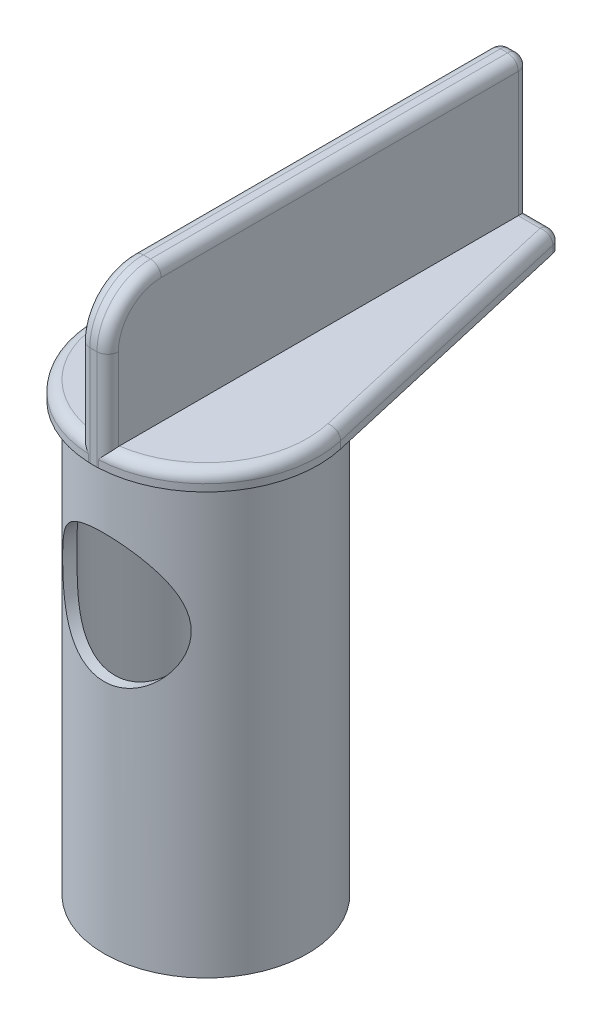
ISO-10303-21;
HEADER;
FILE_DESCRIPTION(('STEP AP214'),'2;1');
FILE_NAME('part.step','',(''),(''),'','','');
FILE_SCHEMA(('AUTOMOTIVE_DESIGN { 1 0 10303 214 1 1 1 1 }'));
ENDSEC;
DATA;
#1=APPLICATION_CONTEXT('core data for automotive mechanical design processes');
#2=APPLICATION_PROTOCOL_DEFINITION('international standard','automotive_design',2000,#1);
#3=PRODUCT_CONTEXT('',#1,'mechanical');
#4=PRODUCT('Part','Part','',(#3));
#5=PRODUCT_RELATED_PRODUCT_CATEGORY('part','',(#4));
#6=PRODUCT_DEFINITION_FORMATION('','',#4);
#7=PRODUCT_DEFINITION_CONTEXT('part definition',#1,'design');
#8=PRODUCT_DEFINITION('design','',#6,#7);
#9=PRODUCT_DEFINITION_SHAPE('','',#8);
#10=(LENGTH_UNIT() NAMED_UNIT(*) SI_UNIT(.MILLI.,.METRE.));
#11=(NAMED_UNIT(*) PLANE_ANGLE_UNIT() SI_UNIT($,.RADIAN.));
#12=(NAMED_UNIT(*) SI_UNIT($,.STERADIAN.) SOLID_ANGLE_UNIT());
#13=UNCERTAINTY_MEASURE_WITH_UNIT(LENGTH_MEASURE(1.E-05),#10,'distance_accuracy_value','');
#14=(GEOMETRIC_REPRESENTATION_CONTEXT(3) GLOBAL_UNCERTAINTY_ASSIGNED_CONTEXT((#13)) GLOBAL_UNIT_ASSIGNED_CONTEXT((#10,
#11,#12)) REPRESENTATION_CONTEXT('',''));
#15=CARTESIAN_POINT('',(0.,0.,0.));
#16=DIRECTION('',(0.,0.,1.));
#17=DIRECTION('',(1.,0.,0.));
#18=AXIS2_PLACEMENT_3D('',#15,#16,#17);
#19=CARTESIAN_POINT('',(0.,-120.,0.));
#20=DIRECTION('',(0.,1.,0.));
#21=DIRECTION('',(0.,0.,1.));
#22=AXIS2_PLACEMENT_3D('',#19,#20,#21);
#23=CYLINDRICAL_SURFACE('',#22,28.5);
#24=CARTESIAN_POINT('',(0.,0.,0.));
#25=DIRECTION('',(0.,1.,0.));
#26=DIRECTION('',(0.,0.,1.));
#27=AXIS2_PLACEMENT_3D('',#24,#25,#26);
#28=CIRCLE('',#27,28.5);
#29=CARTESIAN_POINT('',(0.,0.,28.5));
#30=VERTEX_POINT('',#29);
#31=EDGE_CURVE('E247',#30,#30,#28,.T.);
#32=ORIENTED_EDGE('',*,*,#31,.F.);
#33=EDGE_LOOP('',(#32));
#34=FACE_BOUND('',#33,.T.);
#35=CARTESIAN_POINT('',(0.,-120.,0.));
#36=DIRECTION('',(0.,1.,0.));
#37=DIRECTION('',(0.,0.,1.));
#38=AXIS2_PLACEMENT_3D('',#35,#36,#37);
#39=CIRCLE('',#38,28.5);
#40=CARTESIAN_POINT('',(0.,-120.,28.5));
#41=VERTEX_POINT('',#40);
#42=EDGE_CURVE('E250',#41,#41,#39,.T.);
#43=ORIENTED_EDGE('',*,*,#42,.T.);
#44=EDGE_LOOP('',(#43));
#45=FACE_BOUND('',#44,.T.);
#46=CARTESIAN_POINT('',(0.,-54.,28.5));
#47=CARTESIAN_POINT('',(-0.456653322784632,-54.0000004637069,28.5000003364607));
#48=CARTESIAN_POINT('',(-0.913305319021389,-53.9826005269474,28.4890013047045));
#49=CARTESIAN_POINT('',(-1.82310087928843,-53.9132499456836,28.4452773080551));
#50=CARTESIAN_POINT('',(-2.27624298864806,-53.861285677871,28.4125437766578));
#51=CARTESIAN_POINT('',(-3.17600400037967,-53.7234442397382,28.3260938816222));
#52=CARTESIAN_POINT('',(-3.62261185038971,-53.6375152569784,28.2723454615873));
#53=CARTESIAN_POINT('',(-4.50533690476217,-53.4329345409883,28.1451735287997));
#54=CARTESIAN_POINT('',(-4.9414550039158,-53.3142856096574,28.0717517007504));
#55=CARTESIAN_POINT('',(-5.79829031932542,-53.0464168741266,27.9073325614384));
#56=CARTESIAN_POINT('',(-6.2190735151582,-52.8973525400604,27.8164247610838));
#57=CARTESIAN_POINT('',(-7.04520442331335,-52.569928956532,27.6187529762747));
#58=CARTESIAN_POINT('',(-7.45055185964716,-52.3915691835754,27.5119887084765));
#59=CARTESIAN_POINT('',(-8.24381496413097,-52.0073019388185,27.2847890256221));
#60=CARTESIAN_POINT('',(-8.63173504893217,-51.8014014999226,27.1643571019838));
#61=CARTESIAN_POINT('',(-9.38878438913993,-51.3636571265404,26.9120784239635));
#62=CARTESIAN_POINT('',(-9.75791156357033,-51.1318103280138,26.7802304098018));
#63=CARTESIAN_POINT('',(-10.5051170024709,-50.6240445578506,26.4965058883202));
#64=CARTESIAN_POINT('',(-10.8815168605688,-50.3460792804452,26.3438716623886));
#65=CARTESIAN_POINT('',(-11.6097192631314,-49.7634261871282,26.0311633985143));
#66=CARTESIAN_POINT('',(-11.9615207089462,-49.4587371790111,25.8710890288));
#67=CARTESIAN_POINT('',(-12.6399229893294,-48.8237468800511,25.5465049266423));
#68=CARTESIAN_POINT('',(-12.9664911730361,-48.4934134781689,25.3819898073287));
#69=CARTESIAN_POINT('',(-13.5929614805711,-47.8087566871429,25.0520807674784));
#70=CARTESIAN_POINT('',(-13.8928620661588,-47.4544319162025,24.8866867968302));
#71=CARTESIAN_POINT('',(-14.5047631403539,-46.6720014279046,24.5357470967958));
#72=CARTESIAN_POINT('',(-14.8126485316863,-46.2404869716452,24.3505967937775));
#73=CARTESIAN_POINT('',(-15.3907566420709,-45.3491612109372,23.9893899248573));
#74=CARTESIAN_POINT('',(-15.6609720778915,-44.8893444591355,23.8133351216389));
#75=CARTESIAN_POINT('',(-16.1611575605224,-43.943720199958,23.4767490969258));
#76=CARTESIAN_POINT('',(-16.3911821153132,-43.457949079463,23.3161969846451));
#77=CARTESIAN_POINT('',(-16.8087210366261,-42.4620520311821,23.0170138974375));
#78=CARTESIAN_POINT('',(-16.9962534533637,-41.951936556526,22.8783736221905));
#79=CARTESIAN_POINT('',(-17.2823310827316,-41.0480355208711,22.6626146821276));
#80=CARTESIAN_POINT('',(-17.3912986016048,-40.659092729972,22.5789170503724));
#81=CARTESIAN_POINT('',(-17.5834004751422,-39.8714655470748,22.4296424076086));
#82=CARTESIAN_POINT('',(-17.6665389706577,-39.4727827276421,22.3640624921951));
#83=CARTESIAN_POINT('',(-17.8057835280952,-38.6684172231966,22.2533594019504));
#84=CARTESIAN_POINT('',(-17.8619233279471,-38.2627439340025,22.2082107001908));
#85=CARTESIAN_POINT('',(-17.9464616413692,-37.4466449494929,22.1399523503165));
#86=CARTESIAN_POINT('',(-17.9748598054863,-37.0362191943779,22.1168429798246));
#87=CARTESIAN_POINT('',(-18.0034748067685,-36.2125561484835,22.0935566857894));
#88=CARTESIAN_POINT('',(-18.0036111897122,-35.799314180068,22.0934452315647));
#89=CARTESIAN_POINT('',(-17.9754985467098,-34.9744466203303,22.1163236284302));
#90=CARTESIAN_POINT('',(-17.9472493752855,-34.5628210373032,22.139313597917));
#91=CARTESIAN_POINT('',(-17.8628147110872,-33.7440352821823,22.2074936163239));
#92=CARTESIAN_POINT('',(-17.8066095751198,-33.336878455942,22.2526992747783));
#93=CARTESIAN_POINT('',(-17.6671264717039,-32.5300920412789,22.3635987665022));
#94=CARTESIAN_POINT('',(-17.5838479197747,-32.1304626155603,22.4292930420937));
#95=CARTESIAN_POINT('',(-17.3938728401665,-31.3513708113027,22.5769183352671));
#96=CARTESIAN_POINT('',(-17.2878467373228,-30.9716543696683,22.6583790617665));
#97=CARTESIAN_POINT('',(-17.0522897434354,-30.2230216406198,22.836181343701));
#98=CARTESIAN_POINT('',(-16.9227495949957,-29.8541096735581,22.9325287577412));
#99=CARTESIAN_POINT('',(-16.641327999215,-29.1284906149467,23.1375558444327));
#100=CARTESIAN_POINT('',(-16.4894474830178,-28.7717830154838,23.2462350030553));
#101=CARTESIAN_POINT('',(-16.164374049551,-28.0714383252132,23.4734390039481));
#102=CARTESIAN_POINT('',(-15.9911782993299,-27.7278029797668,23.5919651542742));
#103=CARTESIAN_POINT('',(-15.5895951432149,-26.9904134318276,23.859657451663));
#104=CARTESIAN_POINT('',(-15.3569712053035,-26.5995230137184,24.0103697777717));
#105=CARTESIAN_POINT('',(-14.8642139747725,-25.8382693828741,24.3185032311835));
#106=CARTESIAN_POINT('',(-14.6040781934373,-25.4679080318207,24.4759249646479));
#107=CARTESIAN_POINT('',(-14.0571635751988,-24.7483085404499,24.7940782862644));
#108=CARTESIAN_POINT('',(-13.7703601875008,-24.3990903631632,24.9548128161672));
#109=CARTESIAN_POINT('',(-13.1712813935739,-23.7231386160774,25.2761333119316));
#110=CARTESIAN_POINT('',(-12.8590042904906,-23.3964065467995,25.4367192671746));
#111=CARTESIAN_POINT('',(-12.1538416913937,-22.7122123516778,25.7820409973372));
#112=CARTESIAN_POINT('',(-11.7563438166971,-22.3591727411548,25.9661637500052));
#113=CARTESIAN_POINT('',(-10.9290341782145,-21.6877661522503,26.3250747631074));
#114=CARTESIAN_POINT('',(-10.4992184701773,-21.3694034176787,26.499861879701));
#115=CARTESIAN_POINT('',(-9.60918335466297,-20.7700511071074,26.8354189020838));
#116=CARTESIAN_POINT('',(-9.14896958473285,-20.4890546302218,26.9961913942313));
#117=CARTESIAN_POINT('',(-8.20045117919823,-19.9673628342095,27.2992743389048));
#118=CARTESIAN_POINT('',(-7.71214981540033,-19.7266628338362,27.441586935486));
#119=CARTESIAN_POINT('',(-6.73605813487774,-19.2998620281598,27.6968749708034));
#120=CARTESIAN_POINT('',(-6.24950656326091,-19.1116059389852,27.8109748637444));
#121=CARTESIAN_POINT('',(-5.25733402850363,-18.776920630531,28.0154760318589));
#122=CARTESIAN_POINT('',(-4.75171335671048,-18.6304907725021,28.1058776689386));
#123=CARTESIAN_POINT('',(-3.72634484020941,-18.3820467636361,28.2600919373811));
#124=CARTESIAN_POINT('',(-3.20661513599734,-18.2799782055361,28.3239371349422));
#125=CARTESIAN_POINT('',(-2.15753781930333,-18.1219057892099,28.4230968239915));
#126=CARTESIAN_POINT('',(-1.62819195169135,-18.065893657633,28.4584164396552));
#127=CARTESIAN_POINT('',(-0.646243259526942,-18.0059359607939,28.4962443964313));
#128=CARTESIAN_POINT('',(-0.194189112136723,-17.9953772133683,28.5029197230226));
#129=CARTESIAN_POINT('',(0.709204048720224,-18.0083068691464,28.494753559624));
#130=CARTESIAN_POINT('',(1.16054314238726,-18.0317911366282,28.4799146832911));
#131=CARTESIAN_POINT('',(2.0589445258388,-18.1124575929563,28.4290907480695));
#132=CARTESIAN_POINT('',(2.50600713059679,-18.1696372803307,28.3931072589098));
#133=CARTESIAN_POINT('',(3.39255076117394,-18.3168861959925,28.3008696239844));
#134=CARTESIAN_POINT('',(3.83203167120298,-18.4069559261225,28.2446151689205));
#135=CARTESIAN_POINT('',(4.6814242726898,-18.6141726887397,28.1160220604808));
#136=CARTESIAN_POINT('',(5.0917899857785,-18.7299688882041,28.0444910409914));
#137=CARTESIAN_POINT('',(5.90046919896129,-18.9892750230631,27.8855566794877));
#138=CARTESIAN_POINT('',(6.29878324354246,-19.1327837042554,27.7981540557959));
#139=CARTESIAN_POINT('',(7.08142728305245,-19.4461156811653,27.6091556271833));
#140=CARTESIAN_POINT('',(7.46575697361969,-19.6159395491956,27.507559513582));
#141=CARTESIAN_POINT('',(8.21885729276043,-19.9804668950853,27.2920105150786));
#142=CARTESIAN_POINT('',(8.58762598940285,-20.175173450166,27.1780561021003));
#143=CARTESIAN_POINT('',(9.34420974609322,-20.6086291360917,26.9278649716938));
#144=CARTESIAN_POINT('',(9.73025824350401,-20.8498339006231,26.7905394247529));
#145=CARTESIAN_POINT('',(10.4805489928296,-21.3588373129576,26.506020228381));
#146=CARTESIAN_POINT('',(10.8447900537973,-21.6266374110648,26.358826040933));
#147=CARTESIAN_POINT('',(11.5506981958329,-22.1875131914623,26.0572221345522));
#148=CARTESIAN_POINT('',(11.8923432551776,-22.4806129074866,25.9028056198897));
#149=CARTESIAN_POINT('',(12.5517449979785,-23.0904909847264,25.5897817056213));
#150=CARTESIAN_POINT('',(12.8695001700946,-23.4072708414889,25.4311740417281));
#151=CARTESIAN_POINT('',(13.5257002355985,-24.1121686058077,25.0890794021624));
#152=CARTESIAN_POINT('',(13.8601887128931,-24.5038878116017,24.9054020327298));
#153=CARTESIAN_POINT('',(14.495109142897,-25.3155557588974,24.5413074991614));
#154=CARTESIAN_POINT('',(14.7955353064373,-25.7355092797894,24.360890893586));
#155=CARTESIAN_POINT('',(15.3605326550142,-26.6020502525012,24.0086404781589));
#156=CARTESIAN_POINT('',(15.6251184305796,-27.0486267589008,23.836803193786));
#157=CARTESIAN_POINT('',(16.1165341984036,-27.9670425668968,23.5073357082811));
#158=CARTESIAN_POINT('',(16.3433744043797,-28.4388749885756,23.3497016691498));
#159=CARTESIAN_POINT('',(16.7142560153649,-29.3061319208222,23.0851537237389));
#160=CARTESIAN_POINT('',(16.8657251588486,-29.6972448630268,22.9744843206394));
#161=CARTESIAN_POINT('',(17.1419998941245,-30.4928170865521,22.7690904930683));
#162=CARTESIAN_POINT('',(17.2668115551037,-30.8972733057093,22.6743624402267));
#163=CARTESIAN_POINT('',(17.4882240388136,-31.7172325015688,22.5040339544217));
#164=CARTESIAN_POINT('',(17.5848614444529,-32.1327203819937,22.4284087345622));
#165=CARTESIAN_POINT('',(17.7487846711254,-32.972828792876,22.2989145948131));
#166=CARTESIAN_POINT('',(17.8160706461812,-33.3974492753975,22.2450455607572));
#167=CARTESIAN_POINT('',(17.9205127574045,-34.2555271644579,22.1609969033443));
#168=CARTESIAN_POINT('',(17.9574731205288,-34.6890237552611,22.130971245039));
#169=CARTESIAN_POINT('',(17.9998504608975,-35.5585833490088,22.096518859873));
#170=CARTESIAN_POINT('',(18.005267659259,-35.9946463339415,22.0920919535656));
#171=CARTESIAN_POINT('',(17.9844526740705,-36.8656038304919,22.1090395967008));
#172=CARTESIAN_POINT('',(17.9582131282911,-37.3004980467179,22.130420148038));
#173=CARTESIAN_POINT('',(17.8745688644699,-38.16529690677,22.1980327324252));
#174=CARTESIAN_POINT('',(17.8171647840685,-38.5952016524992,22.2442642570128));
#175=CARTESIAN_POINT('',(17.6787458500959,-39.4082833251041,22.3543950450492));
#176=CARTESIAN_POINT('',(17.6003279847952,-39.7921771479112,22.4163243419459));
#177=CARTESIAN_POINT('',(17.419494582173,-40.551205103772,22.5571348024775));
#178=CARTESIAN_POINT('',(17.3170713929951,-40.9263364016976,22.6360213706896));
#179=CARTESIAN_POINT('',(17.089315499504,-41.6661392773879,22.8084561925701));
#180=CARTESIAN_POINT('',(16.9639799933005,-42.0308095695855,22.9020062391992));
#181=CARTESIAN_POINT('',(16.6914939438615,-42.7484343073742,23.1013531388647));
#182=CARTESIAN_POINT('',(16.5443426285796,-43.1013883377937,23.2071504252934));
#183=CARTESIAN_POINT('',(16.2070128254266,-43.8435639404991,23.4442101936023));
#184=CARTESIAN_POINT('',(16.0136930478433,-44.2308832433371,23.5769599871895));
#185=CARTESIAN_POINT('',(15.601287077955,-44.9880897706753,23.8518606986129));
#186=CARTESIAN_POINT('',(15.3821973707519,-45.3579746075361,23.9940128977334));
#187=CARTESIAN_POINT('',(14.919254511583,-46.079669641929,24.2845746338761));
#188=CARTESIAN_POINT('',(14.6753862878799,-46.4314686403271,24.4329879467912));
#189=CARTESIAN_POINT('',(14.1639521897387,-47.1159803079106,24.7329815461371));
#190=CARTESIAN_POINT('',(13.8963845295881,-47.4486915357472,24.8845620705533));
#191=CARTESIAN_POINT('',(13.2804995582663,-48.1611537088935,25.2195424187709));
#192=CARTESIAN_POINT('',(12.9269419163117,-48.5363558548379,25.4030236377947));
#193=CARTESIAN_POINT('',(12.1878017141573,-49.2560781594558,25.7658111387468));
#194=CARTESIAN_POINT('',(11.8022149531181,-49.6005942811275,25.9451168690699));
#195=CARTESIAN_POINT('',(11.0001104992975,-50.2571506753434,26.2952310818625));
#196=CARTESIAN_POINT('',(10.5835691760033,-50.5691656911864,26.4660329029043));
#197=CARTESIAN_POINT('',(9.72149355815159,-51.1580007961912,26.7946883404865));
#198=CARTESIAN_POINT('',(9.27596130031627,-51.4348233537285,26.9525428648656));
#199=CARTESIAN_POINT('',(8.35262368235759,-51.9535985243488,27.2529275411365));
#200=CARTESIAN_POINT('',(7.87450266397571,-52.1951070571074,27.3952576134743));
#201=CARTESIAN_POINT('',(6.89351640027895,-52.6363658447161,27.6584035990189));
#202=CARTESIAN_POINT('',(6.390647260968,-52.8361095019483,27.7792161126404));
#203=CARTESIAN_POINT('',(5.36557112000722,-53.190223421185,27.9952523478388));
#204=CARTESIAN_POINT('',(4.84342694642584,-53.3447285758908,28.0905520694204));
#205=CARTESIAN_POINT('',(3.78340096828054,-53.6063492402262,28.2528400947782));
#206=CARTESIAN_POINT('',(3.24553064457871,-53.7134984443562,28.3198485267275));
#207=CARTESIAN_POINT('',(2.25680847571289,-53.8636556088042,28.4140366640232));
#208=CARTESIAN_POINT('',(1.80763472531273,-53.9147166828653,28.4462017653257));
#209=CARTESIAN_POINT('',(0.905640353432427,-53.9828896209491,28.4891838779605));
#210=CARTESIAN_POINT('',(0.452819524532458,-53.9999995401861,28.4999996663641));
#211=CARTESIAN_POINT('',(0.,-54.,28.5));
#212=B_SPLINE_CURVE_WITH_KNOTS('',3,(#46,#47,#48,#49,#50,#51,#52,#53,#54,#55,#56,#57,#58,#59,
#60,#61,#62,#63,#64,#65,#66,#67,#68,#69,#70,#71,#72,#73,#74,#75,#76,#77,#78,#79,#80,#81,#82,#83,
#84,#85,#86,#87,#88,#89,#90,#91,#92,#93,#94,#95,#96,#97,#98,#99,#100,#101,#102,#103,#104,#105,
#106,#107,#108,#109,#110,#111,#112,#113,#114,#115,#116,#117,#118,#119,#120,#121,#122,#123,#124,
#125,#126,#127,#128,#129,#130,#131,#132,#133,#134,#135,#136,#137,#138,#139,#140,#141,#142,#143,
#144,#145,#146,#147,#148,#149,#150,#151,#152,#153,#154,#155,#156,#157,#158,#159,#160,#161,#162,
#163,#164,#165,#166,#167,#168,#169,#170,#171,#172,#173,#174,#175,#176,#177,#178,#179,#180,#181,
#182,#183,#184,#185,#186,#187,#188,#189,#190,#191,#192,#193,#194,#195,#196,#197,#198,#199,#200,
#201,#202,#203,#204,#205,#206,#207,#208,#209,#210,#211),.UNSPECIFIED.,.T.,.F.,(4,2,2,2,2,2,2,2,
2,2,2,2,2,2,2,2,2,2,2,2,2,2,2,2,2,2,2,2,2,2,2,2,2,2,2,2,2,2,2,2,2,2,2,2,2,2,2,2,2,2,2,2,2,2,2,2,
2,2,2,2,2,2,2,2,2,2,2,2,2,2,2,2,2,2,2,2,2,2,2,2,2,2,4),(0.,1.36949805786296,2.73953621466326,
4.1116724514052,5.48369122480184,6.84886504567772,8.21406326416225,9.57891352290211,
10.9439145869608,12.4189855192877,13.8941222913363,15.3711369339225,16.8482367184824,
18.5307073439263,20.2135028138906,21.8939980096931,23.5737780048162,24.8100866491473,
26.0461969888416,27.2807586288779,28.5153358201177,29.7534274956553,30.9915255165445,
32.2304947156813,33.4694906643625,34.6760379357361,35.8830612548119,37.0900342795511,
38.297167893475,39.7333735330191,41.1697092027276,42.6073805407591,44.0451477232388,
45.7309495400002,47.4169574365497,49.1026535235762,50.7881536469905,52.387873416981,
53.9875687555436,55.5852965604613,57.1827372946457,58.5376783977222,59.8924549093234,
61.2471308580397,62.6018274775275,63.8974964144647,65.193106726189,66.4887452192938,
67.784544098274,69.209531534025,70.6345967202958,72.0610308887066,73.4875552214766,
75.1263365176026,76.7653959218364,78.4037860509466,80.0417321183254,81.3418602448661,
82.6416920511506,83.9398284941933,85.2379581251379,86.5444035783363,87.8508398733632,
89.1575800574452,90.4642935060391,91.6531316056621,92.8423491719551,94.0317122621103,
95.221117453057,96.5782083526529,97.9354845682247,99.2935913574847,100.651800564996,
102.291602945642,103.931620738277,105.572903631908,107.214071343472,108.874369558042,
110.534929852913,112.190487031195,113.844864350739,115.202787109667,116.560787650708),.UNSPECIFIED.);
#213=CARTESIAN_POINT('',(0.,-54.,28.5));
#214=VERTEX_POINT('',#213);
#215=EDGE_CURVE('E378',#214,#214,#212,.T.);
#216=ORIENTED_EDGE('',*,*,#215,.T.);
#217=EDGE_LOOP('',(#216));
#218=FACE_BOUND('',#217,.T.);
#219=ADVANCED_FACE('F31',(#34,#45,#218),#23,.T.);
#220=CARTESIAN_POINT('',(0.,-120.,0.));
#221=DIRECTION('',(0.,1.,0.));
#222=DIRECTION('',(0.,0.,1.));
#223=AXIS2_PLACEMENT_3D('',#220,#221,#222);
#224=CYLINDRICAL_SURFACE('',#223,25.5);
#225=CARTESIAN_POINT('',(0.,0.,0.));
#226=DIRECTION('',(0.,-1.,0.));
#227=DIRECTION('',(0.,0.,-1.));
#228=AXIS2_PLACEMENT_3D('',#225,#226,#227);
#229=CIRCLE('',#228,25.5);
#230=CARTESIAN_POINT('',(0.,0.,-25.5));
#231=VERTEX_POINT('',#230);
#232=EDGE_CURVE('E199',#231,#231,#229,.F.);
#233=ORIENTED_EDGE('',*,*,#232,.T.);
#234=EDGE_LOOP('',(#233));
#235=FACE_BOUND('',#234,.T.);
#236=CARTESIAN_POINT('',(0.,-120.,0.));
#237=DIRECTION('',(0.,1.,0.));
#238=DIRECTION('',(0.,0.,1.));
#239=AXIS2_PLACEMENT_3D('',#236,#237,#238);
#240=CIRCLE('',#239,25.5);
#241=CARTESIAN_POINT('',(0.,-120.,25.5));
#242=VERTEX_POINT('',#241);
#243=EDGE_CURVE('E244',#242,#242,#240,.T.);
#244=ORIENTED_EDGE('',*,*,#243,.F.);
#245=EDGE_LOOP('',(#244));
#246=FACE_BOUND('',#245,.T.);
#247=CARTESIAN_POINT('',(0.,-54.,25.5));
#248=CARTESIAN_POINT('',(-0.445860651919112,-53.9999959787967,25.4999961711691));
#249=CARTESIAN_POINT('',(-0.891883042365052,-53.9834029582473,25.4882760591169));
#250=CARTESIAN_POINT('',(-1.78046490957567,-53.917273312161,25.4416616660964));
#251=CARTESIAN_POINT('',(-2.22302182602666,-53.8677142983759,25.4067516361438));
#252=CARTESIAN_POINT('',(-3.10206314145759,-53.7362668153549,25.3144813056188));
#253=CARTESIAN_POINT('',(-3.53852985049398,-53.654298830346,25.2570657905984));
#254=CARTESIAN_POINT('',(-4.40099778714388,-53.4592868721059,25.1211428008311));
#255=CARTESIAN_POINT('',(-4.8270006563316,-53.3462478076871,25.0426386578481));
#256=CARTESIAN_POINT('',(-5.6634203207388,-53.0913925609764,24.8667900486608));
#257=CARTESIAN_POINT('',(-6.07391424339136,-52.9497500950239,24.7695594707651));
#258=CARTESIAN_POINT('',(-6.87976598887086,-52.6389707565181,24.5579396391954));
#259=CARTESIAN_POINT('',(-7.27512326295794,-52.4698328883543,24.4435497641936));
#260=CARTESIAN_POINT('',(-8.04872688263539,-52.105919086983,24.1998425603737));
#261=CARTESIAN_POINT('',(-8.42698328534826,-51.911158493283,24.0705341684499));
#262=CARTESIAN_POINT('',(-9.1653609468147,-51.497589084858,23.7991788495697));
#263=CARTESIAN_POINT('',(-9.52547992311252,-51.2787772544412,23.6571303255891));
#264=CARTESIAN_POINT('',(-10.2577811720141,-50.7981902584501,23.3495045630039));
#265=CARTESIAN_POINT('',(-10.6281838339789,-50.5343245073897,23.1829584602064));
#266=CARTESIAN_POINT('',(-11.3453419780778,-49.9817089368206,22.8405590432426));
#267=CARTESIAN_POINT('',(-11.6920962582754,-49.6929578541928,22.664705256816));
#268=CARTESIAN_POINT('',(-12.3617457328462,-49.0916027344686,22.3065376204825));
#269=CARTESIAN_POINT('',(-12.6846047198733,-48.7789639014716,22.1242145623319));
#270=CARTESIAN_POINT('',(-13.3052881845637,-48.1313846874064,21.7565952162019));
#271=CARTESIAN_POINT('',(-13.6031112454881,-47.7964430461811,21.5712987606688));
#272=CARTESIAN_POINT('',(-14.2242414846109,-47.0431038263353,21.1679352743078));
#273=CARTESIAN_POINT('',(-14.5425390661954,-46.6205124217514,20.9499512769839));
#274=CARTESIAN_POINT('',(-15.1422128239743,-45.7465076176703,20.5207070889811));
#275=CARTESIAN_POINT('',(-15.4235792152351,-45.295086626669,20.3094486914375));
#276=CARTESIAN_POINT('',(-15.9472557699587,-44.3647750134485,19.9008822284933));
#277=CARTESIAN_POINT('',(-16.1896152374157,-43.8859201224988,19.7035567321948));
#278=CARTESIAN_POINT('',(-16.5221574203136,-43.1478033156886,19.423937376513));
#279=CARTESIAN_POINT('',(-16.6278229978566,-42.8985036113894,19.3334733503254));
#280=CARTESIAN_POINT('',(-16.8285193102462,-42.3933419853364,19.1590344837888));
#281=CARTESIAN_POINT('',(-16.9235475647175,-42.1374785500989,19.0750611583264));
#282=CARTESIAN_POINT('',(-17.1354932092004,-41.5240787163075,18.8852300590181));
#283=CARTESIAN_POINT('',(-17.2475768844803,-41.1638124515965,18.7827072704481));
#284=CARTESIAN_POINT('',(-17.4497518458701,-40.4328212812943,18.5950318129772));
#285=CARTESIAN_POINT('',(-17.539849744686,-40.0620995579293,18.5098739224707));
#286=CARTESIAN_POINT('',(-17.6967453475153,-39.3123405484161,18.3599289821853));
#287=CARTESIAN_POINT('',(-17.7635827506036,-38.9333186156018,18.2951072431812));
#288=CARTESIAN_POINT('',(-17.873063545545,-38.1685869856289,18.1881689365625));
#289=CARTESIAN_POINT('',(-17.9157069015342,-37.7828772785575,18.1460524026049));
#290=CARTESIAN_POINT('',(-17.9761650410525,-37.0052284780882,18.0861643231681));
#291=CARTESIAN_POINT('',(-17.9938270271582,-36.6132657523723,18.0685426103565));
#292=CARTESIAN_POINT('',(-18.0034596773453,-35.8287183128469,18.0589448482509));
#293=CARTESIAN_POINT('',(-17.9954310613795,-35.4361336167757,18.0669680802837));
#294=CARTESIAN_POINT('',(-17.9538393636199,-34.6533805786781,18.1082991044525));
#295=CARTESIAN_POINT('',(-17.9202571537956,-34.2632142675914,18.1416258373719));
#296=CARTESIAN_POINT('',(-17.8282138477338,-33.4886307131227,18.2320847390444));
#297=CARTESIAN_POINT('',(-17.7697499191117,-33.1042141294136,18.2892196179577));
#298=CARTESIAN_POINT('',(-17.6194854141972,-32.2923977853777,18.4340998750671));
#299=CARTESIAN_POINT('',(-17.5242544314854,-31.8661856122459,18.5249324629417));
#300=CARTESIAN_POINT('',(-17.3048683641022,-31.0271022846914,18.7300296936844));
#301=CARTESIAN_POINT('',(-17.1807087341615,-30.6142332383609,18.8442980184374));
#302=CARTESIAN_POINT('',(-16.9050112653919,-29.8028615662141,19.0920129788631));
#303=CARTESIAN_POINT('',(-16.7534252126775,-29.4043857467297,19.2254933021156));
#304=CARTESIAN_POINT('',(-16.4246168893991,-28.6235878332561,19.5071482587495));
#305=CARTESIAN_POINT('',(-16.2473924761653,-28.2412670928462,19.6553241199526));
#306=CARTESIAN_POINT('',(-15.8130412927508,-27.383638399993,20.0074247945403));
#307=CARTESIAN_POINT('',(-15.5477245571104,-26.913944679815,20.2149543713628));
#308=CARTESIAN_POINT('',(-14.9785296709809,-26.0033981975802,20.6402509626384));
#309=CARTESIAN_POINT('',(-14.6746412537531,-25.5625531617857,20.8580206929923));
#310=CARTESIAN_POINT('',(-14.0296077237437,-24.7103648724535,21.2972410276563));
#311=CARTESIAN_POINT('',(-13.688433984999,-24.2990446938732,21.5186943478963));
#312=CARTESIAN_POINT('',(-12.9702073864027,-23.5076330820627,21.9590797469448));
#313=CARTESIAN_POINT('',(-12.5931580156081,-23.1275386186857,22.1780120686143));
#314=CARTESIAN_POINT('',(-11.800778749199,-22.3972679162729,22.6096632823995));
#315=CARTESIAN_POINT('',(-11.3851492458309,-22.0473751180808,22.8223130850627));
#316=CARTESIAN_POINT('',(-10.5195809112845,-21.3837117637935,23.2339872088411));
#317=CARTESIAN_POINT('',(-10.0696387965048,-21.0699446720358,23.433010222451));
#318=CARTESIAN_POINT('',(-9.13792841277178,-20.4822415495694,23.8117711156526));
#319=CARTESIAN_POINT('',(-8.65622292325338,-20.2082301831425,23.9915452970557));
#320=CARTESIAN_POINT('',(-7.91147803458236,-19.8294674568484,24.2430870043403));
#321=CARTESIAN_POINT('',(-7.65955517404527,-19.7085981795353,24.3239079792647));
#322=CARTESIAN_POINT('',(-7.14857951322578,-19.4780029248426,24.4789520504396));
#323=CARTESIAN_POINT('',(-6.88952494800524,-19.3682797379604,24.5531734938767));
#324=CARTESIAN_POINT('',(-6.23608557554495,-19.1095265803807,24.7290347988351));
#325=CARTESIAN_POINT('',(-5.83765099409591,-18.9676170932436,24.8262650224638));
#326=CARTESIAN_POINT('',(-5.0282310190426,-18.7113600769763,25.0027687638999));
#327=CARTESIAN_POINT('',(-4.61724830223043,-18.5970067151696,25.0820460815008));
#328=CARTESIAN_POINT('',(-3.78524564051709,-18.397306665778,25.2210164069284));
#329=CARTESIAN_POINT('',(-3.36423106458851,-18.3119448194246,25.2807196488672));
#330=CARTESIAN_POINT('',(-2.5147649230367,-18.1713350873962,25.379298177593));
#331=CARTESIAN_POINT('',(-2.08631314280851,-18.1160880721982,25.4181728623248));
#332=CARTESIAN_POINT('',(-1.22386581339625,-18.0364194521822,25.4742894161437));
#333=CARTESIAN_POINT('',(-0.789857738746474,-18.012088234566,25.491467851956));
#334=CARTESIAN_POINT('',(0.0790926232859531,-17.9949289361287,25.5035790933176));
#335=CARTESIAN_POINT('',(0.514034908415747,-18.0021007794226,25.4985119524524));
#336=CARTESIAN_POINT('',(1.38148413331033,-18.0478365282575,25.4662504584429));
#337=CARTESIAN_POINT('',(1.81399077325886,-18.0864042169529,25.4390534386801));
#338=CARTESIAN_POINT('',(2.67321422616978,-18.1943433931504,25.3631609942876));
#339=CARTESIAN_POINT('',(3.09993112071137,-18.2637144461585,25.3144658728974));
#340=CARTESIAN_POINT('',(3.92657405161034,-18.4286580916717,25.1991812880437));
#341=CARTESIAN_POINT('',(4.32686776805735,-18.5229912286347,25.1334406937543));
#342=CARTESIAN_POINT('',(5.11702750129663,-18.73779688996,24.9845485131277));
#343=CARTESIAN_POINT('',(5.50689389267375,-18.8582684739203,24.9013975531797));
#344=CARTESIAN_POINT('',(6.27426421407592,-19.1240256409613,24.7192061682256));
#345=CARTESIAN_POINT('',(6.65176714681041,-19.2693132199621,24.6201644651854));
#346=CARTESIAN_POINT('',(7.39278367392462,-19.5832797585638,24.4078947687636));
#347=CARTESIAN_POINT('',(7.75629645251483,-19.7519600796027,24.2946659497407));
#348=CARTESIAN_POINT('',(8.50183362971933,-20.1283475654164,24.0444949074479));
#349=CARTESIAN_POINT('',(8.88234187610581,-20.3382391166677,23.9063220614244));
#350=CARTESIAN_POINT('',(9.62378577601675,-20.7825892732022,23.6176007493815));
#351=CARTESIAN_POINT('',(9.98472040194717,-21.0170491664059,23.4670516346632));
#352=CARTESIAN_POINT('',(10.68631566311,-21.5090934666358,23.155992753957));
#353=CARTESIAN_POINT('',(11.0269626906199,-21.7666931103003,22.9954764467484));
#354=CARTESIAN_POINT('',(11.6870538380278,-22.3035118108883,22.6671280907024));
#355=CARTESIAN_POINT('',(12.0064955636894,-22.5827333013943,22.4992952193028));
#356=CARTESIAN_POINT('',(12.6788925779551,-23.2135005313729,22.1284492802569));
#357=CARTESIAN_POINT('',(13.0276025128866,-23.5690426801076,21.9245192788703));
#358=CARTESIAN_POINT('',(13.6939504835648,-24.3071391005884,21.5146175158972));
#359=CARTESIAN_POINT('',(14.0115830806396,-24.6896980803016,21.3086454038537));
#360=CARTESIAN_POINT('',(14.6149262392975,-25.4808959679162,20.8994458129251));
#361=CARTESIAN_POINT('',(14.9006236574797,-25.8895455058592,20.6962194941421));
#362=CARTESIAN_POINT('',(15.4386983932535,-26.7319731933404,20.2979939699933));
#363=CARTESIAN_POINT('',(15.6910824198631,-27.1657462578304,20.1029931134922));
#364=CARTESIAN_POINT('',(16.1201276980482,-27.9803352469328,19.7598920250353));
#365=CARTESIAN_POINT('',(16.3023295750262,-28.3572821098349,19.6095244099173));
#366=CARTESIAN_POINT('',(16.6416381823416,-29.1273815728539,19.3224032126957));
#367=CARTESIAN_POINT('',(16.7987456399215,-29.5205337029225,19.1856492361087));
#368=CARTESIAN_POINT('',(17.0860949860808,-30.3214411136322,18.9301949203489));
#369=CARTESIAN_POINT('',(17.2163836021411,-30.7291695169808,18.8114632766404));
#370=CARTESIAN_POINT('',(17.4486919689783,-31.5583366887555,18.5961901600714));
#371=CARTESIAN_POINT('',(17.5507177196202,-31.9797725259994,18.4996439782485));
#372=CARTESIAN_POINT('',(17.7100549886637,-32.7619014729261,18.3470427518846));
#373=CARTESIAN_POINT('',(17.7720052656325,-33.1208551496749,18.2869052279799));
#374=CARTESIAN_POINT('',(17.8742263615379,-33.8446467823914,18.1870055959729));
#375=CARTESIAN_POINT('',(17.9144997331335,-34.2094840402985,18.1472410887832));
#376=CARTESIAN_POINT('',(17.9726596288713,-34.9423949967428,18.0896433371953));
#377=CARTESIAN_POINT('',(17.9905633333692,-35.3104659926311,18.0717932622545));
#378=CARTESIAN_POINT('',(18.0037098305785,-36.0474285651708,18.0586966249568));
#379=CARTESIAN_POINT('',(17.9989521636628,-36.4163201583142,18.0634505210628));
#380=CARTESIAN_POINT('',(17.9668773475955,-37.1518340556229,18.0953534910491));
#381=CARTESIAN_POINT('',(17.9395784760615,-37.5184579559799,18.1224844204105));
#382=CARTESIAN_POINT('',(17.8629386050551,-38.2471456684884,18.1980300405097));
#383=CARTESIAN_POINT('',(17.8135977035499,-38.6092095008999,18.246444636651));
#384=CARTESIAN_POINT('',(17.6936113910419,-39.3269595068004,18.3628178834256));
#385=CARTESIAN_POINT('',(17.6229440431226,-39.6826387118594,18.4307966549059));
#386=CARTESIAN_POINT('',(17.4612665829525,-40.3857046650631,18.5840404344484));
#387=CARTESIAN_POINT('',(17.3702448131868,-40.7330865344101,18.6693153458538));
#388=CARTESIAN_POINT('',(17.1328978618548,-41.5406376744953,18.8877815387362));
#389=CARTESIAN_POINT('',(16.9784339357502,-41.9967437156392,19.0272054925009));
#390=CARTESIAN_POINT('',(16.636401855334,-42.8890164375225,19.326970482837));
#391=CARTESIAN_POINT('',(16.4488354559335,-43.3251841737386,19.4873104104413));
#392=CARTESIAN_POINT('',(16.0422551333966,-44.1773650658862,19.8233628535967));
#393=CARTESIAN_POINT('',(15.8231889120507,-44.5933431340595,19.9991007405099));
#394=CARTESIAN_POINT('',(15.3554441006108,-45.4036800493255,20.3604438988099));
#395=CARTESIAN_POINT('',(15.1067681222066,-45.7980407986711,20.5460482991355));
#396=CARTESIAN_POINT('',(14.5742882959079,-46.5743677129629,20.927255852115));
#397=CARTESIAN_POINT('',(14.2897538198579,-46.9557663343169,21.1229931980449));
#398=CARTESIAN_POINT('',(13.6916966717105,-47.6945852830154,21.5154686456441));
#399=CARTESIAN_POINT('',(13.3781728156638,-48.0520046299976,21.7122067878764));
#400=CARTESIAN_POINT('',(12.7231271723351,-48.7415860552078,22.1024270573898));
#401=CARTESIAN_POINT('',(12.3816247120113,-49.0737652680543,22.2959113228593));
#402=CARTESIAN_POINT('',(11.6711739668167,-49.7117322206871,22.6758895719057));
#403=CARTESIAN_POINT('',(11.3022271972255,-50.0175214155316,22.8623839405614));
#404=CARTESIAN_POINT('',(10.5517659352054,-50.5902275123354,23.2180156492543));
#405=CARTESIAN_POINT('',(10.1712105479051,-50.858159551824,23.3875388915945));
#406=CARTESIAN_POINT('',(9.38642734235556,-51.365983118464,23.7134037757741));
#407=CARTESIAN_POINT('',(8.98219904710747,-51.6058740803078,23.8697451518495));
#408=CARTESIAN_POINT('',(8.15146992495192,-52.0554175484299,24.1660476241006));
#409=CARTESIAN_POINT('',(7.7249723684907,-52.2650744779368,24.3060111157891));
#410=CARTESIAN_POINT('',(7.07019907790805,-52.5550384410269,24.50131059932));
#411=CARTESIAN_POINT('',(6.84944496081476,-52.6476033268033,24.5639674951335));
#412=CARTESIAN_POINT('',(6.40312473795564,-52.8243161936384,24.6840720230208));
#413=CARTESIAN_POINT('',(6.17755736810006,-52.9084619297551,24.7415182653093));
#414=CARTESIAN_POINT('',(5.55495345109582,-53.1265118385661,24.8909065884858));
#415=CARTESIAN_POINT('',(5.15344800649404,-53.2516676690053,24.9772616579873));
#416=CARTESIAN_POINT('',(4.33941042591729,-53.4741964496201,25.1314764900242));
#417=CARTESIAN_POINT('',(3.92688002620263,-53.5715737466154,25.1993391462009));
#418=CARTESIAN_POINT('',(3.09426253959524,-53.7371158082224,25.3150504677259));
#419=CARTESIAN_POINT('',(2.67419575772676,-53.8053494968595,25.3629463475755));
#420=CARTESIAN_POINT('',(1.82862000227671,-53.9119383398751,25.4378868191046));
#421=CARTESIAN_POINT('',(1.40311448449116,-53.9503115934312,25.4649440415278));
#422=CARTESIAN_POINT('',(0.813988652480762,-53.9823234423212,25.4875250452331));
#423=CARTESIAN_POINT('',(0.651310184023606,-53.9889495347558,25.4922006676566));
#424=CARTESIAN_POINT('',(0.325761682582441,-53.9977887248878,25.4984389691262));
#425=CARTESIAN_POINT('',(0.162891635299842,-54.0000014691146,25.5000013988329));
#426=CARTESIAN_POINT('',(0.,-54.,25.5));
#427=B_SPLINE_CURVE_WITH_KNOTS('',3,(#247,#248,#249,#250,#251,#252,#253,#254,#255,#256,#257,
#258,#259,#260,#261,#262,#263,#264,#265,#266,#267,#268,#269,#270,#271,#272,#273,#274,#275,#276,
#277,#278,#279,#280,#281,#282,#283,#284,#285,#286,#287,#288,#289,#290,#291,#292,#293,#294,#295,
#296,#297,#298,#299,#300,#301,#302,#303,#304,#305,#306,#307,#308,#309,#310,#311,#312,#313,#314,
#315,#316,#317,#318,#319,#320,#321,#322,#323,#324,#325,#326,#327,#328,#329,#330,#331,#332,#333,
#334,#335,#336,#337,#338,#339,#340,#341,#342,#343,#344,#345,#346,#347,#348,#349,#350,#351,#352,
#353,#354,#355,#356,#357,#358,#359,#360,#361,#362,#363,#364,#365,#366,#367,#368,#369,#370,#371,
#372,#373,#374,#375,#376,#377,#378,#379,#380,#381,#382,#383,#384,#385,#386,#387,#388,#389,#390,
#391,#392,#393,#394,#395,#396,#397,#398,#399,#400,#401,#402,#403,#404,#405,#406,#407,#408,#409,
#410,#411,#412,#413,#414,#415,#416,#417,#418,#419,#420,#421,#422,#423,#424,#425,#426),
.UNSPECIFIED.,.T.,.F.,(4,2,2,2,2,2,2,2,2,2,2,2,2,2,2,2,2,2,2,2,2,2,2,2,2,2,2,2,2,2,2,2,2,2,2,2,
2,2,2,2,2,2,2,2,2,2,2,2,2,2,2,2,2,2,2,2,2,2,2,2,2,2,2,2,2,2,2,2,2,2,2,2,2,2,2,2,2,2,2,2,2,2,2,2,
2,2,2,2,2,4),(0.,1.33740393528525,2.67571707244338,4.01733435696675,5.35873980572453,
6.69223112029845,8.0257707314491,9.35851559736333,10.6914277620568,12.142988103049,
13.5946221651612,15.0484125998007,16.5022852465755,18.2169147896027,19.9319977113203,
21.6448954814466,22.5010473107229,23.3573983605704,24.5292393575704,25.7007274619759,
26.8702062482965,28.0396867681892,29.2162898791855,30.39286001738,31.5703117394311,
32.7478975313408,34.0841533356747,35.4206192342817,36.7594577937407,38.0984083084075,
39.830055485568,41.5621645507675,43.2956129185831,45.0288928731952,46.7769854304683,
48.5252454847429,50.2701481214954,51.142445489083,52.0149607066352,53.315471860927,
54.6157074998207,55.915262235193,57.2148545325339,58.5182377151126,59.8216177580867,
61.12515487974,62.4286736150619,63.6767688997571,64.924819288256,66.1729701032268,
67.4211935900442,68.7878513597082,70.1545808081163,71.5222168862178,72.890007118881,
74.5027848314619,76.1158442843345,77.7295651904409,79.3429606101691,80.6764388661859,
82.009878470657,83.3409747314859,84.6717881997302,85.7782111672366,86.8845038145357,
87.9899462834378,89.0954111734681,90.1999805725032,91.3045450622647,92.4102496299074,
93.5165890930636,95.0183400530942,96.5200114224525,98.0242053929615,99.5282667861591,
101.070452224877,102.612700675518,104.153892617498,105.694999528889,107.179511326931,
108.664053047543,110.14837735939,110.890486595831,111.632793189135,112.919318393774,
114.205642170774,115.48890674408,116.771392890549,117.259963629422,117.748573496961),.UNSPECIFIED.);
#428=CARTESIAN_POINT('',(0.,-54.,25.5));
#429=VERTEX_POINT('',#428);
#430=EDGE_CURVE('E36',#429,#429,#427,.T.);
#431=ORIENTED_EDGE('',*,*,#430,.F.);
#432=EDGE_LOOP('',(#431));
#433=FACE_BOUND('',#432,.T.);
#434=ADVANCED_FACE('F364',(#235,#246,#433),#224,.F.);
#435=CARTESIAN_POINT('',(0.,5.,0.));
#436=DIRECTION('',(0.,-1.,0.));
#437=DIRECTION('',(0.,0.,-1.));
#438=AXIS2_PLACEMENT_3D('',#435,#436,#437);
#439=CYLINDRICAL_SURFACE('',#438,31.5);
#440=CARTESIAN_POINT('',(0.,2.,0.));
#441=DIRECTION('',(0.,-1.,0.));
#442=DIRECTION('',(0.,0.,-1.));
#443=AXIS2_PLACEMENT_3D('',#440,#441,#442);
#444=CIRCLE('',#443,31.5);
#445=CARTESIAN_POINT('',(30.7046023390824,2.,-7.03401700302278));
#446=VERTEX_POINT('',#445);
#447=CARTESIAN_POINT('',(1.44474018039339,2.,31.4668512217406));
#448=VERTEX_POINT('',#447);
#449=EDGE_CURVE('E60',#446,#448,#444,.T.);
#450=ORIENTED_EDGE('',*,*,#449,.T.);
#451=DIRECTION('',(0.,-1.,0.));
#452=VECTOR('',#451,1.);
#453=CARTESIAN_POINT('',(1.44474018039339,2.,31.4668512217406));
#454=LINE('',#453,#452);
#455=CARTESIAN_POINT('',(1.44474018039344,0.,31.4668512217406));
#456=VERTEX_POINT('',#455);
#457=EDGE_CURVE('E469',#448,#456,#454,.T.);
#458=ORIENTED_EDGE('',*,*,#457,.T.);
#459=CARTESIAN_POINT('',(0.,0.,0.));
#460=DIRECTION('',(0.,1.,0.));
#461=DIRECTION('',(0.,0.,1.));
#462=AXIS2_PLACEMENT_3D('',#459,#460,#461);
#463=CIRCLE('',#462,31.5);
#464=CARTESIAN_POINT('',(30.7046023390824,0.,-7.03401700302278));
#465=VERTEX_POINT('',#464);
#466=EDGE_CURVE('E209',#456,#465,#463,.T.);
#467=ORIENTED_EDGE('',*,*,#466,.T.);
#468=DIRECTION('',(0.,-1.,0.));
#469=VECTOR('',#468,1.);
#470=CARTESIAN_POINT('',(30.7046023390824,5.,-7.03401700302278));
#471=LINE('',#470,#469);
#472=EDGE_CURVE('E238',#446,#465,#471,.T.);
#473=ORIENTED_EDGE('',*,*,#472,.F.);
#474=EDGE_LOOP('',(#450,#458,#467,#473));
#475=FACE_BOUND('',#474,.T.);
#476=ADVANCED_FACE('F360',(#475),#439,.T.);
#477=CARTESIAN_POINT('',(-10.1095456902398,5.,-83.5));
#478=DIRECTION('',(0.,-1.,0.));
#479=DIRECTION('',(0.,0.,-1.));
#480=AXIS2_PLACEMENT_3D('',#477,#478,#479);
#481=PLANE('',#480);
#482=DIRECTION('',(0.,0.,-1.));
#483=VECTOR('',#482,1.);
#484=CARTESIAN_POINT('',(4.,5.,-83.5));
#485=LINE('',#484,#483);
#486=CARTESIAN_POINT('',(4.,5.,28.2179021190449));
#487=VERTEX_POINT('',#486);
#488=CARTESIAN_POINT('',(4.,5.,-83.5));
#489=VERTEX_POINT('',#488);
#490=EDGE_CURVE('E221',#487,#489,#485,.T.);
#491=ORIENTED_EDGE('',*,*,#490,.F.);
#492=CARTESIAN_POINT('',(0.,5.,0.));
#493=DIRECTION('',(0.,-1.,0.));
#494=DIRECTION('',(0.,0.,-1.));
#495=AXIS2_PLACEMENT_3D('',#492,#493,#494);
#496=CIRCLE('',#495,28.5);
#497=CARTESIAN_POINT('',(27.7803544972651,5.,-6.36411062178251));
#498=VERTEX_POINT('',#497);
#499=EDGE_CURVE('E253',#487,#498,#496,.F.);
#500=ORIENTED_EDGE('',*,*,#499,.T.);
#501=DIRECTION('',(-0.223302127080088,0.,-0.974749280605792));
#502=VECTOR('',#501,1.);
#503=CARTESIAN_POINT('',(9.10134415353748,5.,-87.9009599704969));
#504=LINE('',#503,#502);
#505=CARTESIAN_POINT('',(10.1095456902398,5.,-83.5));
#506=VERTEX_POINT('',#505);
#507=EDGE_CURVE('E257',#498,#506,#504,.T.);
#508=ORIENTED_EDGE('',*,*,#507,.T.);
#509=DIRECTION('',(-1.,0.,0.));
#510=VECTOR('',#509,1.);
#511=CARTESIAN_POINT('',(-10.1095456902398,5.,-83.5));
#512=LINE('',#511,#510);
#513=EDGE_CURVE('E260',#506,#489,#512,.T.);
#514=ORIENTED_EDGE('',*,*,#513,.T.);
#515=EDGE_LOOP('',(#491,#500,#508,#514));
#516=FACE_BOUND('',#515,.T.);
#517=ADVANCED_FACE('F339',(#516),#481,.F.);
#518=CARTESIAN_POINT('',(-10.1095456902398,2.,-83.5));
#519=DIRECTION('',(-1.,0.,0.));
#520=DIRECTION('',(0.,0.,1.));
#521=AXIS2_PLACEMENT_3D('',#518,#519,#520);
#522=CYLINDRICAL_SURFACE('',#521,3.);
#523=DIRECTION('',(-1.,0.,0.));
#524=VECTOR('',#523,1.);
#525=CARTESIAN_POINT('',(-10.1095456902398,2.,-86.5));
#526=LINE('',#525,#524);
#527=CARTESIAN_POINT('',(1.,2.,-86.5));
#528=VERTEX_POINT('',#527);
#529=CARTESIAN_POINT('',(10.1095456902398,2.,-86.5));
#530=VERTEX_POINT('',#529);
#531=EDGE_CURVE('E269',#528,#530,#526,.F.);
#532=ORIENTED_EDGE('',*,*,#531,.F.);
#533=CARTESIAN_POINT('',(1.,2.,-83.5));
#534=DIRECTION('',(-0.707106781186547,0.707106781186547,0.));
#535=DIRECTION('',(0.707106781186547,0.707106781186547,0.));
#536=AXIS2_PLACEMENT_3D('',#533,#534,#535);
#537=ELLIPSE('',#536,4.24264068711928,3.);
#538=EDGE_CURVE('E415',#528,#489,#537,.F.);
#539=ORIENTED_EDGE('',*,*,#538,.T.);
#540=ORIENTED_EDGE('',*,*,#513,.F.);
#541=CARTESIAN_POINT('',(10.1095456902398,2.,-83.5));
#542=DIRECTION('',(-1.,0.,0.));
#543=DIRECTION('',(0.,0.,1.));
#544=AXIS2_PLACEMENT_3D('',#541,#542,#543);
#545=CIRCLE('',#544,3.);
#546=EDGE_CURVE('E215',#506,#530,#545,.T.);
#547=ORIENTED_EDGE('',*,*,#546,.T.);
#548=EDGE_LOOP('',(#532,#539,#540,#547));
#549=FACE_BOUND('',#548,.T.);
#550=ADVANCED_FACE('F572',(#549),#522,.T.);
#551=CARTESIAN_POINT('',(0.,2.,0.));
#552=DIRECTION('',(0.,-1.,0.));
#553=DIRECTION('',(0.,0.,-1.));
#554=AXIS2_PLACEMENT_3D('',#551,#552,#553);
#555=TOROIDAL_SURFACE('',#554,28.5,3.);
#556=ORIENTED_EDGE('',*,*,#499,.F.);
#557=CARTESIAN_POINT('',(4.,2.80164618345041,25.2947715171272));
#558=CARTESIAN_POINT('',(4.,2.96358023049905,25.3402419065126));
#559=CARTESIAN_POINT('',(4.,3.12176808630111,25.3995292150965));
#560=CARTESIAN_POINT('',(4.,3.42602916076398,25.5439555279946));
#561=CARTESIAN_POINT('',(4.,3.57208643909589,25.6291278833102));
#562=CARTESIAN_POINT('',(4.,3.84773978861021,25.8226561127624));
#563=CARTESIAN_POINT('',(4.,3.97735122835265,25.9309900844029));
#564=CARTESIAN_POINT('',(4.,4.21669384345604,26.1676834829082));
#565=CARTESIAN_POINT('',(4.,4.32642965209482,26.2960382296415));
#566=CARTESIAN_POINT('',(4.,4.52396336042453,26.5702764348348));
#567=CARTESIAN_POINT('',(4.,4.61157085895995,26.716297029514));
#568=CARTESIAN_POINT('',(4.,4.7613116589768,27.0208699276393));
#569=CARTESIAN_POINT('',(4.,4.82344255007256,27.1794234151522));
#570=CARTESIAN_POINT('',(4.,4.92105469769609,27.5062433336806));
#571=CARTESIAN_POINT('',(4.,4.95626671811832,27.6745902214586));
#572=CARTESIAN_POINT('',(4.,4.99805860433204,28.0148035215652));
#573=CARTESIAN_POINT('',(4.,5.00463760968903,28.1866700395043));
#574=CARTESIAN_POINT('',(4.,4.9889235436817,28.5297928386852));
#575=CARTESIAN_POINT('',(4.,4.9665115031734,28.7010436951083));
#576=CARTESIAN_POINT('',(4.,4.89318036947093,29.0373324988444));
#577=CARTESIAN_POINT('',(4.,4.8422614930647,29.2023704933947));
#578=CARTESIAN_POINT('',(4.,4.71344788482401,29.5210611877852));
#579=CARTESIAN_POINT('',(4.,4.6356242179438,29.6747425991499));
#580=CARTESIAN_POINT('',(4.,4.45509796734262,29.9667275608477));
#581=CARTESIAN_POINT('',(4.,4.3523962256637,30.1050316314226));
#582=CARTESIAN_POINT('',(4.,4.12581772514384,30.3612379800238));
#583=CARTESIAN_POINT('',(4.,4.00210151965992,30.4792822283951));
#584=CARTESIAN_POINT('',(4.,3.73645758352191,30.692705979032));
#585=CARTESIAN_POINT('',(4.,3.59453072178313,30.7880865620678));
#586=CARTESIAN_POINT('',(4.,3.29780892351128,30.9526148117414));
#587=CARTESIAN_POINT('',(4.,3.14313522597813,31.0219811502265));
#588=CARTESIAN_POINT('',(4.,2.82428651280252,31.1335632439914));
#589=CARTESIAN_POINT('',(4.,2.66011188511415,31.1757801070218));
#590=CARTESIAN_POINT('',(4.,2.32809588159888,31.2316105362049));
#591=CARTESIAN_POINT('',(4.,2.16028617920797,31.2454125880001));
#592=CARTESIAN_POINT('',(4.,1.82474032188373,31.2445677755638));
#593=CARTESIAN_POINT('',(4.,1.65700416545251,31.2299215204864));
#594=CARTESIAN_POINT('',(4.,1.3268142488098,31.172691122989));
#595=CARTESIAN_POINT('',(4.,1.16434806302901,31.1301786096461));
#596=CARTESIAN_POINT('',(4.,0.848835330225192,31.0185408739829));
#597=CARTESIAN_POINT('',(4.,0.695788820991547,30.9494155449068));
#598=CARTESIAN_POINT('',(4.,0.403064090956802,30.7863895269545));
#599=CARTESIAN_POINT('',(4.,0.263416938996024,30.6924330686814));
#600=CARTESIAN_POINT('',(4.,0.00175148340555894,30.4825474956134));
#601=CARTESIAN_POINT('',(4.,-0.120266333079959,30.3666177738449));
#602=CARTESIAN_POINT('',(4.,-0.344063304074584,30.1153034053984));
#603=CARTESIAN_POINT('',(4.,-0.445708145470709,29.9797991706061));
#604=CARTESIAN_POINT('',(4.,-0.62503098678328,29.6937676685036));
#605=CARTESIAN_POINT('',(4.,-0.702707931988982,29.5432397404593));
#606=CARTESIAN_POINT('',(4.,-0.83258951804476,29.2300661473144));
#607=CARTESIAN_POINT('',(4.,-0.884572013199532,29.0673283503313));
#608=CARTESIAN_POINT('',(4.,-0.960707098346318,28.7354681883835));
#609=CARTESIAN_POINT('',(4.,-0.984858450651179,28.5663455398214));
#610=CARTESIAN_POINT('',(4.,-1.0047962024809,28.2251489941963));
#611=CARTESIAN_POINT('',(4.,-1.0003665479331,28.0530624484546));
#612=CARTESIAN_POINT('',(4.,-0.96278198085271,27.7120519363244));
#613=CARTESIAN_POINT('',(4.,-0.929626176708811,27.5431280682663));
#614=CARTESIAN_POINT('',(4.,-0.835342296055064,27.2126742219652));
#615=CARTESIAN_POINT('',(4.,-0.774123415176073,27.0511701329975));
#616=CARTESIAN_POINT('',(4.,-0.625352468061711,26.7407775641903));
#617=CARTESIAN_POINT('',(4.,-0.53780052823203,26.5918890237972));
#618=CARTESIAN_POINT('',(4.,-0.339101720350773,26.3115397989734));
#619=CARTESIAN_POINT('',(4.,-0.228035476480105,26.1800219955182));
#620=CARTESIAN_POINT('',(4.,0.0147885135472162,25.9377262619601));
#621=CARTESIAN_POINT('',(4.,0.146544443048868,25.8269465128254));
#622=CARTESIAN_POINT('',(4.,0.425668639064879,25.6304353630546));
#623=CARTESIAN_POINT('',(4.,0.572873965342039,25.5444725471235));
#624=CARTESIAN_POINT('',(4.,0.879795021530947,25.3987908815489));
#625=CARTESIAN_POINT('',(4.,1.03951306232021,25.3390768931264));
#626=CARTESIAN_POINT('',(4.,1.36498807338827,25.248283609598));
#627=CARTESIAN_POINT('',(4.,1.53065991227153,25.2168983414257));
#628=CARTESIAN_POINT('',(4.,1.86478214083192,25.1826604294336));
#629=CARTESIAN_POINT('',(4.,2.03322868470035,25.1797711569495));
#630=CARTESIAN_POINT('',(4.,2.30221409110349,25.1980083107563));
#631=CARTESIAN_POINT('',(4.,2.40344489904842,25.2101497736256));
#632=CARTESIAN_POINT('',(4.,2.60412389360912,25.2447620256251));
#633=CARTESIAN_POINT('',(4.,2.70357209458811,25.2672327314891));
#634=CARTESIAN_POINT('',(4.,2.80164618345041,25.2947715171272));
#635=B_SPLINE_CURVE_WITH_KNOTS('',3,(#557,#558,#559,#560,#561,#562,#563,#564,#565,#566,#567,
#568,#569,#570,#571,#572,#573,#574,#575,#576,#577,#578,#579,#580,#581,#582,#583,#584,#585,#586,
#587,#588,#589,#590,#591,#592,#593,#594,#595,#596,#597,#598,#599,#600,#601,#602,#603,#604,#605,
#606,#607,#608,#609,#610,#611,#612,#613,#614,#615,#616,#617,#618,#619,#620,#621,#622,#623,#624,
#625,#626,#627,#628,#629,#630,#631,#632,#633,#634),.UNSPECIFIED.,.T.,.F.,(4,2,2,2,2,2,2,2,2,2,2,
2,2,2,2,2,2,2,2,2,2,2,2,2,2,2,2,2,2,2,2,2,2,2,2,2,2,2,4),(0.,0.504213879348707,1.00908017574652,
1.51347114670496,2.01774438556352,2.52621915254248,3.03474201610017,3.5482867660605,
4.06184694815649,4.57752130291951,5.09319173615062,5.60751038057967,6.12181161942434,
6.6323470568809,7.1428581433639,7.64897627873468,8.15507376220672,8.65780315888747,
9.16052179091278,9.6619532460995,10.1633867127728,10.6659560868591,11.1685393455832,
11.6743342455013,12.180151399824,12.6902683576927,13.2004080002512,13.7144084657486,
14.2284248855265,14.744116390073,15.2598054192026,15.7737541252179,16.2876577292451,
16.7966018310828,17.3056401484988,17.8091122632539,18.3119371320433,18.6173127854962,
18.9226859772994),.UNSPECIFIED.);
#636=CARTESIAN_POINT('',(4.,4.98696721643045,28.5));
#637=VERTEX_POINT('',#636);
#638=EDGE_CURVE('E296',#487,#637,#635,.T.);
#639=ORIENTED_EDGE('',*,*,#638,.T.);
#640=CARTESIAN_POINT('',(4.,4.98696721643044,28.5));
#641=CARTESIAN_POINT('',(4.00001702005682,4.98031617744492,28.5719834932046));
#642=CARTESIAN_POINT('',(3.99740998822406,4.97111900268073,28.6436991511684));
#643=CARTESIAN_POINT('',(3.98718982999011,4.94797281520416,28.7859112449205));
#644=CARTESIAN_POINT('',(3.97958290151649,4.93402969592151,28.8564090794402));
#645=CARTESIAN_POINT('',(3.95969672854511,4.90186423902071,28.9950354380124));
#646=CARTESIAN_POINT('',(3.94746159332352,4.88368290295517,29.0631798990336));
#647=CARTESIAN_POINT('',(3.91863552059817,4.84335520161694,29.1973377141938));
#648=CARTESIAN_POINT('',(3.90204334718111,4.82120771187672,29.2633504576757));
#649=CARTESIAN_POINT('',(3.84642273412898,4.74963386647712,29.456983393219));
#650=CARTESIAN_POINT('',(3.8014293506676,4.69488426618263,29.5809956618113));
#651=CARTESIAN_POINT('',(3.69825592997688,4.57406522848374,29.8176419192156));
#652=CARTESIAN_POINT('',(3.64004132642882,4.50796623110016,29.9302449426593));
#653=CARTESIAN_POINT('',(3.48255226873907,4.33320577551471,30.1942589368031));
#654=CARTESIAN_POINT('',(3.37695231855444,4.21930203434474,30.3384920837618));
#655=CARTESIAN_POINT('',(3.20626202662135,4.03866126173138,30.5346924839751));
#656=CARTESIAN_POINT('',(3.14721640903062,3.97671382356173,30.5968144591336));
#657=CARTESIAN_POINT('',(3.02563269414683,3.85002631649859,30.7144881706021));
#658=CARTESIAN_POINT('',(2.96309476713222,3.78528638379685,30.770040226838));
#659=CARTESIAN_POINT('',(2.81471451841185,3.63242336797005,30.8913820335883));
#660=CARTESIAN_POINT('',(2.72780708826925,3.54343453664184,30.9547768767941));
#661=CARTESIAN_POINT('',(2.55020420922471,3.362099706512,31.0706228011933));
#662=CARTESIAN_POINT('',(2.45950671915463,3.26975190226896,31.1230678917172));
#663=CARTESIAN_POINT('',(2.27590003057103,3.08228310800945,31.217114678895));
#664=CARTESIAN_POINT('',(2.18299619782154,2.98716874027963,31.2587402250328));
#665=CARTESIAN_POINT('',(1.99640068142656,2.79384100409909,31.3314502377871));
#666=CARTESIAN_POINT('',(1.90270974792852,2.69563038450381,31.362543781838));
#667=CARTESIAN_POINT('',(1.77442175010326,2.55419032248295,31.3985733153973));
#668=CARTESIAN_POINT('',(1.73824421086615,2.51350131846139,31.4079793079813));
#669=CARTESIAN_POINT('',(1.66726906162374,2.43048286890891,31.4250758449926));
#670=CARTESIAN_POINT('',(1.63247245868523,2.38815226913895,31.4327651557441));
#671=CARTESIAN_POINT('',(1.57702991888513,2.3147987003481,31.4440723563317));
#672=CARTESIAN_POINT('',(1.55545495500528,2.28456147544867,31.4482018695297));
#673=CARTESIAN_POINT('',(1.51535955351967,2.22193431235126,31.4554712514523));
#674=CARTESIAN_POINT('',(1.49683390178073,2.18954818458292,31.4586128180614));
#675=CARTESIAN_POINT('',(1.47287578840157,2.13626623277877,31.4625106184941));
#676=CARTESIAN_POINT('',(1.46524062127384,2.11642911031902,31.4637114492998));
#677=CARTESIAN_POINT('',(1.45325841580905,2.07580388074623,31.4655683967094));
#678=CARTESIAN_POINT('',(1.44889386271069,2.05502148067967,31.4662274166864));
#679=CARTESIAN_POINT('',(1.44535440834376,2.02272917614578,31.4667588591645));
#680=CARTESIAN_POINT('',(1.44471346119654,2.01137138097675,31.4668540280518));
#681=CARTESIAN_POINT('',(1.44474018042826,1.9999999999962,31.4668512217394));
#682=B_SPLINE_CURVE_WITH_KNOTS('',3,(#640,#641,#642,#643,#644,#645,#646,#647,#648,#649,#650,
#651,#652,#653,#654,#655,#656,#657,#658,#659,#660,#661,#662,#663,#664,#665,#666,#667,#668,#669,
#670,#671,#672,#673,#674,#675,#676,#677,#678,#679,#680,#681),.UNSPECIFIED.,.F.,.F.,(4,2,2,2,2,2,
2,2,2,2,2,2,2,2,2,2,2,2,2,2,4),(0.,0.216729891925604,0.43319162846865,0.647640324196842,
0.862149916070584,1.28871377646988,1.71640597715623,2.34853525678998,2.66557796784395,
2.9826052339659,3.4008609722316,3.81934494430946,4.23689847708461,4.65409120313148,
4.8198231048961,4.98567372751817,5.09772996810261,5.20959256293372,5.2732768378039,
5.33661758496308,5.37069411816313),.UNSPECIFIED.);
#683=EDGE_CURVE('E463',#637,#448,#682,.T.);
#684=ORIENTED_EDGE('',*,*,#683,.T.);
#685=ORIENTED_EDGE('',*,*,#449,.F.);
#686=CARTESIAN_POINT('',(27.7803544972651,2.,-6.36411062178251));
#687=DIRECTION('',(0.223302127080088,0.,0.974749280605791));
#688=DIRECTION('',(0.974749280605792,0.,-0.223302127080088));
#689=AXIS2_PLACEMENT_3D('',#686,#687,#688);
#690=CIRCLE('',#689,3.);
#691=EDGE_CURVE('E282',#446,#498,#690,.T.);
#692=ORIENTED_EDGE('',*,*,#691,.T.);
#693=EDGE_LOOP('',(#556,#639,#684,#685,#692));
#694=FACE_BOUND('',#693,.T.);
#695=ADVANCED_FACE('F372',(#694),#555,.T.);
#696=CARTESIAN_POINT('',(0.,-120.,0.));
#697=DIRECTION('',(0.,1.,0.));
#698=DIRECTION('',(0.,0.,1.));
#699=AXIS2_PLACEMENT_3D('',#696,#697,#698);
#700=PLANE('',#699);
#701=ORIENTED_EDGE('',*,*,#243,.T.);
#702=EDGE_LOOP('',(#701));
#703=FACE_BOUND('',#702,.T.);
#704=ORIENTED_EDGE('',*,*,#42,.F.);
#705=EDGE_LOOP('',(#704));
#706=FACE_BOUND('',#705,.T.);
#707=ADVANCED_FACE('F369',(#703,#706),#700,.F.);
#708=CARTESIAN_POINT('',(-10.1095456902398,0.,-83.5));
#709=DIRECTION('',(0.,-1.,0.));
#710=DIRECTION('',(0.,0.,-1.));
#711=AXIS2_PLACEMENT_3D('',#708,#709,#710);
#712=PLANE('',#711);
#713=ORIENTED_EDGE('',*,*,#232,.F.);
#714=EDGE_LOOP('',(#713));
#715=FACE_BOUND('',#714,.T.);
#716=ADVANCED_FACE('F344',(#715),#712,.T.);
#717=CARTESIAN_POINT('',(-10.1095456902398,5.,-83.5));
#718=DIRECTION('',(0.,-1.,0.));
#719=DIRECTION('',(0.,0.,-1.));
#720=AXIS2_PLACEMENT_3D('',#717,#718,#719);
#721=CYLINDRICAL_SURFACE('',#720,3.);
#722=DIRECTION('',(0.,-1.,0.));
#723=VECTOR('',#722,1.);
#724=CARTESIAN_POINT('',(-13.0337935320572,5.,-84.1699063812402));
#725=LINE('',#724,#723);
#726=CARTESIAN_POINT('',(-13.0337935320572,2.,-84.1699063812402));
#727=VERTEX_POINT('',#726);
#728=CARTESIAN_POINT('',(-13.0337935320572,0.,-84.1699063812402));
#729=VERTEX_POINT('',#728);
#730=EDGE_CURVE('E189',#727,#729,#725,.T.);
#731=ORIENTED_EDGE('',*,*,#730,.F.);
#732=CARTESIAN_POINT('',(-10.1095456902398,2.,-83.5));
#733=DIRECTION('',(0.,-1.,0.));
#734=DIRECTION('',(0.,0.,-1.));
#735=AXIS2_PLACEMENT_3D('',#732,#733,#734);
#736=CIRCLE('',#735,3.);
#737=CARTESIAN_POINT('',(-10.1095456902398,2.,-86.5));
#738=VERTEX_POINT('',#737);
#739=EDGE_CURVE('E267',#727,#738,#736,.T.);
#740=ORIENTED_EDGE('',*,*,#739,.T.);
#741=DIRECTION('',(0.,-1.,0.));
#742=VECTOR('',#741,1.);
#743=CARTESIAN_POINT('',(-10.1095456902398,5.,-86.5));
#744=LINE('',#743,#742);
#745=CARTESIAN_POINT('',(-10.1095456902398,0.,-86.5));
#746=VERTEX_POINT('',#745);
#747=EDGE_CURVE('E214',#738,#746,#744,.T.);
#748=ORIENTED_EDGE('',*,*,#747,.T.);
#749=CARTESIAN_POINT('',(-10.1095456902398,0.,-83.5));
#750=DIRECTION('',(0.,1.,0.));
#751=DIRECTION('',(0.,0.,-1.));
#752=AXIS2_PLACEMENT_3D('',#749,#750,#751);
#753=CIRCLE('',#752,3.);
#754=EDGE_CURVE('E206',#746,#729,#753,.T.);
#755=ORIENTED_EDGE('',*,*,#754,.T.);
#756=EDGE_LOOP('',(#731,#740,#748,#755));
#757=FACE_BOUND('',#756,.T.);
#758=ADVANCED_FACE('F212',(#757),#721,.T.);
#759=CARTESIAN_POINT('',(-13.0337935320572,5.,-84.1699063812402));
#760=DIRECTION('',(0.974749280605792,0.,0.223302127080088));
#761=DIRECTION('',(0.223302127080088,0.,-0.974749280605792));
#762=AXIS2_PLACEMENT_3D('',#759,#760,#761);
#763=PLANE('',#762);
#764=DIRECTION('',(0.,-1.,0.));
#765=VECTOR('',#764,1.);
#766=CARTESIAN_POINT('',(-30.7046023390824,5.,-7.03401700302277));
#767=LINE('',#766,#765);
#768=CARTESIAN_POINT('',(-30.7046023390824,2.,-7.03401700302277));
#769=VERTEX_POINT('',#768);
#770=CARTESIAN_POINT('',(-30.7046023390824,0.,-7.03401700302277));
#771=VERTEX_POINT('',#770);
#772=EDGE_CURVE('E200',#769,#771,#767,.T.);
#773=ORIENTED_EDGE('',*,*,#772,.F.);
#774=DIRECTION('',(-0.223302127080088,0.,0.974749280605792));
#775=VECTOR('',#774,1.);
#776=CARTESIAN_POINT('',(-13.0337935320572,2.,-84.1699063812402));
#777=LINE('',#776,#775);
#778=EDGE_CURVE('E196',#769,#727,#777,.F.);
#779=ORIENTED_EDGE('',*,*,#778,.T.);
#780=ORIENTED_EDGE('',*,*,#730,.T.);
#781=DIRECTION('',(-0.223302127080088,0.,0.974749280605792));
#782=VECTOR('',#781,1.);
#783=CARTESIAN_POINT('',(-13.0337935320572,0.,-84.1699063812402));
#784=LINE('',#783,#782);
#785=EDGE_CURVE('E193',#729,#771,#784,.T.);
#786=ORIENTED_EDGE('',*,*,#785,.T.);
#787=EDGE_LOOP('',(#773,#779,#780,#786));
#788=FACE_BOUND('',#787,.T.);
#789=ADVANCED_FACE('F192',(#788),#763,.F.);
#790=CARTESIAN_POINT('',(-1.44474018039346,0.,31.4668512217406));
#791=VERTEX_POINT('',#790);
#792=EDGE_CURVE('E208',#771,#791,#463,.T.);
#793=ORIENTED_EDGE('',*,*,#792,.T.);
#794=DIRECTION('',(0.,1.,0.));
#795=VECTOR('',#794,1.);
#796=CARTESIAN_POINT('',(-1.44474018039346,0.,31.4668512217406));
#797=LINE('',#796,#795);
#798=CARTESIAN_POINT('',(-1.44474018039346,2.,31.4668512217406));
#799=VERTEX_POINT('',#798);
#800=EDGE_CURVE('E45',#791,#799,#797,.T.);
#801=ORIENTED_EDGE('',*,*,#800,.T.);
#802=EDGE_CURVE('E52',#799,#769,#444,.T.);
#803=ORIENTED_EDGE('',*,*,#802,.T.);
#804=ORIENTED_EDGE('',*,*,#772,.T.);
#805=EDGE_LOOP('',(#793,#801,#803,#804));
#806=FACE_BOUND('',#805,.T.);
#807=ADVANCED_FACE('F355',(#806),#439,.T.);
#808=CARTESIAN_POINT('',(13.0337935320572,5.,-84.1699063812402));
#809=DIRECTION('',(-0.974749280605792,0.,0.223302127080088));
#810=DIRECTION('',(0.223302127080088,0.,0.974749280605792));
#811=AXIS2_PLACEMENT_3D('',#808,#809,#810);
#812=PLANE('',#811);
#813=DIRECTION('',(0.,-1.,0.));
#814=VECTOR('',#813,1.);
#815=CARTESIAN_POINT('',(13.0337935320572,5.,-84.1699063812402));
#816=LINE('',#815,#814);
#817=CARTESIAN_POINT('',(13.0337935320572,2.,-84.1699063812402));
#818=VERTEX_POINT('',#817);
#819=CARTESIAN_POINT('',(13.0337935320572,0.,-84.1699063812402));
#820=VERTEX_POINT('',#819);
#821=EDGE_CURVE('E236',#818,#820,#816,.T.);
#822=ORIENTED_EDGE('',*,*,#821,.F.);
#823=DIRECTION('',(-0.223302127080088,0.,-0.974749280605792));
#824=VECTOR('',#823,1.);
#825=CARTESIAN_POINT('',(13.0337935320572,2.,-84.1699063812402));
#826=LINE('',#825,#824);
#827=EDGE_CURVE('E274',#818,#446,#826,.F.);
#828=ORIENTED_EDGE('',*,*,#827,.T.);
#829=ORIENTED_EDGE('',*,*,#472,.T.);
#830=DIRECTION('',(-0.223302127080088,0.,-0.974749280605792));
#831=VECTOR('',#830,1.);
#832=CARTESIAN_POINT('',(13.0337935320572,0.,-84.1699063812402));
#833=LINE('',#832,#831);
#834=EDGE_CURVE('E225',#465,#820,#833,.T.);
#835=ORIENTED_EDGE('',*,*,#834,.T.);
#836=EDGE_LOOP('',(#822,#828,#829,#835));
#837=FACE_BOUND('',#836,.T.);
#838=ADVANCED_FACE('F351',(#837),#812,.F.);
#839=CARTESIAN_POINT('',(10.1095456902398,5.,-83.5));
#840=DIRECTION('',(0.,-1.,0.));
#841=DIRECTION('',(0.,0.,-1.));
#842=AXIS2_PLACEMENT_3D('',#839,#840,#841);
#843=CYLINDRICAL_SURFACE('',#842,3.);
#844=DIRECTION('',(0.,-1.,0.));
#845=VECTOR('',#844,1.);
#846=CARTESIAN_POINT('',(10.1095456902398,5.,-86.5));
#847=LINE('',#846,#845);
#848=CARTESIAN_POINT('',(10.1095456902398,0.,-86.5));
#849=VERTEX_POINT('',#848);
#850=EDGE_CURVE('E234',#530,#849,#847,.T.);
#851=ORIENTED_EDGE('',*,*,#850,.F.);
#852=CARTESIAN_POINT('',(10.1095456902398,2.,-83.5));
#853=DIRECTION('',(0.,-1.,0.));
#854=DIRECTION('',(0.,0.,-1.));
#855=AXIS2_PLACEMENT_3D('',#852,#853,#854);
#856=CIRCLE('',#855,3.);
#857=EDGE_CURVE('E272',#530,#818,#856,.T.);
#858=ORIENTED_EDGE('',*,*,#857,.T.);
#859=ORIENTED_EDGE('',*,*,#821,.T.);
#860=CARTESIAN_POINT('',(10.1095456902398,0.,-83.5));
#861=DIRECTION('',(0.,1.,0.));
#862=DIRECTION('',(0.,0.,1.));
#863=AXIS2_PLACEMENT_3D('',#860,#861,#862);
#864=CIRCLE('',#863,3.);
#865=EDGE_CURVE('E228',#820,#849,#864,.T.);
#866=ORIENTED_EDGE('',*,*,#865,.T.);
#867=EDGE_LOOP('',(#851,#858,#859,#866));
#868=FACE_BOUND('',#867,.T.);
#869=ADVANCED_FACE('F347',(#868),#843,.T.);
#870=CARTESIAN_POINT('',(-10.1095456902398,5.,-86.5));
#871=DIRECTION('',(0.,0.,1.));
#872=DIRECTION('',(1.,0.,0.));
#873=AXIS2_PLACEMENT_3D('',#870,#871,#872);
#874=PLANE('',#873);
#875=DIRECTION('',(-1.,0.,0.));
#876=VECTOR('',#875,1.);
#877=CARTESIAN_POINT('',(4.,40.,-86.5));
#878=LINE('',#877,#876);
#879=CARTESIAN_POINT('',(1.,40.,-86.5));
#880=VERTEX_POINT('',#879);
#881=CARTESIAN_POINT('',(-1.,40.,-86.5));
#882=VERTEX_POINT('',#881);
#883=EDGE_CURVE('E397',#880,#882,#878,.T.);
#884=ORIENTED_EDGE('',*,*,#883,.F.);
#885=DIRECTION('',(0.,1.,0.));
#886=VECTOR('',#885,1.);
#887=CARTESIAN_POINT('',(1.,5.,-86.5));
#888=LINE('',#887,#886);
#889=EDGE_CURVE('E423',#880,#528,#888,.F.);
#890=ORIENTED_EDGE('',*,*,#889,.T.);
#891=ORIENTED_EDGE('',*,*,#531,.T.);
#892=ORIENTED_EDGE('',*,*,#850,.T.);
#893=DIRECTION('',(-1.,0.,0.));
#894=VECTOR('',#893,1.);
#895=CARTESIAN_POINT('',(-10.1095456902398,0.,-86.5));
#896=LINE('',#895,#894);
#897=EDGE_CURVE('E231',#849,#746,#896,.T.);
#898=ORIENTED_EDGE('',*,*,#897,.T.);
#899=ORIENTED_EDGE('',*,*,#747,.F.);
#900=CARTESIAN_POINT('',(-1.,2.,-86.5));
#901=VERTEX_POINT('',#900);
#902=EDGE_CURVE('E270',#738,#901,#526,.F.);
#903=ORIENTED_EDGE('',*,*,#902,.T.);
#904=DIRECTION('',(0.,1.,0.));
#905=VECTOR('',#904,1.);
#906=CARTESIAN_POINT('',(-1.,40.,-86.5));
#907=LINE('',#906,#905);
#908=EDGE_CURVE('E419',#901,#882,#907,.T.);
#909=ORIENTED_EDGE('',*,*,#908,.T.);
#910=EDGE_LOOP('',(#884,#890,#891,#892,#898,#899,#903,#909));
#911=FACE_BOUND('',#910,.T.);
#912=ADVANCED_FACE('F337',(#911),#874,.F.);
#913=CARTESIAN_POINT('',(-27.7803544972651,5.,-6.36411062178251));
#914=VERTEX_POINT('',#913);
#915=CARTESIAN_POINT('',(-4.,5.,28.2179021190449));
#916=VERTEX_POINT('',#915);
#917=EDGE_CURVE('E254',#914,#916,#496,.F.);
#918=ORIENTED_EDGE('',*,*,#917,.T.);
#919=DIRECTION('',(0.,0.,-1.));
#920=VECTOR('',#919,1.);
#921=CARTESIAN_POINT('',(-4.,5.,-83.5));
#922=LINE('',#921,#920);
#923=CARTESIAN_POINT('',(-4.,5.,-83.5));
#924=VERTEX_POINT('',#923);
#925=EDGE_CURVE('E399',#916,#924,#922,.T.);
#926=ORIENTED_EDGE('',*,*,#925,.T.);
#927=CARTESIAN_POINT('',(-10.1095456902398,5.,-83.5));
#928=VERTEX_POINT('',#927);
#929=EDGE_CURVE('E259',#924,#928,#512,.T.);
#930=ORIENTED_EDGE('',*,*,#929,.T.);
#931=DIRECTION('',(-0.223302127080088,0.,0.974749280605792));
#932=VECTOR('',#931,1.);
#933=CARTESIAN_POINT('',(-10.1095456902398,5.,-83.5));
#934=LINE('',#933,#932);
#935=EDGE_CURVE('E263',#928,#914,#934,.T.);
#936=ORIENTED_EDGE('',*,*,#935,.T.);
#937=EDGE_LOOP('',(#918,#926,#930,#936));
#938=FACE_BOUND('',#937,.T.);
#939=ADVANCED_FACE('F334',(#938),#481,.F.);
#940=ORIENTED_EDGE('',*,*,#31,.T.);
#941=EDGE_LOOP('',(#940));
#942=FACE_BOUND('',#941,.T.);
#943=ORIENTED_EDGE('',*,*,#466,.F.);
#944=CARTESIAN_POINT('',(1.,0.,28.5));
#945=DIRECTION('',(0.,-1.,0.));
#946=DIRECTION('',(0.,0.,-1.));
#947=AXIS2_PLACEMENT_3D('',#944,#945,#946);
#948=CIRCLE('',#947,3.);
#949=CARTESIAN_POINT('',(1.,0.,31.5));
#950=VERTEX_POINT('',#949);
#951=EDGE_CURVE('E453',#456,#950,#948,.T.);
#952=ORIENTED_EDGE('',*,*,#951,.T.);
#953=DIRECTION('',(-1.,0.,0.));
#954=VECTOR('',#953,1.);
#955=CARTESIAN_POINT('',(4.,0.,31.5));
#956=LINE('',#955,#954);
#957=CARTESIAN_POINT('',(-1.,0.,31.5));
#958=VERTEX_POINT('',#957);
#959=EDGE_CURVE('E384',#950,#958,#956,.T.);
#960=ORIENTED_EDGE('',*,*,#959,.T.);
#961=CARTESIAN_POINT('',(-1.,0.,28.5));
#962=DIRECTION('',(0.,-1.,0.));
#963=DIRECTION('',(0.,0.,-1.));
#964=AXIS2_PLACEMENT_3D('',#961,#962,#963);
#965=CIRCLE('',#964,3.);
#966=EDGE_CURVE('E451',#958,#791,#965,.T.);
#967=ORIENTED_EDGE('',*,*,#966,.T.);
#968=ORIENTED_EDGE('',*,*,#792,.F.);
#969=ORIENTED_EDGE('',*,*,#785,.F.);
#970=ORIENTED_EDGE('',*,*,#754,.F.);
#971=ORIENTED_EDGE('',*,*,#897,.F.);
#972=ORIENTED_EDGE('',*,*,#865,.F.);
#973=ORIENTED_EDGE('',*,*,#834,.F.);
#974=EDGE_LOOP('',(#943,#952,#960,#967,#968,#969,#970,#971,#972,#973));
#975=FACE_BOUND('',#974,.T.);
#976=ADVANCED_FACE('F204',(#942,#975),#712,.T.);
#977=CARTESIAN_POINT('',(10.1095456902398,2.,-83.5));
#978=DIRECTION('',(0.,0.,1.));
#979=DIRECTION('',(1.,0.,0.));
#980=AXIS2_PLACEMENT_3D('',#977,#978,#979);
#981=SPHERICAL_SURFACE('',#980,3.);
#982=CARTESIAN_POINT('',(10.1095456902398,2.,-83.5));
#983=DIRECTION('',(0.223302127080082,0.,0.974749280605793));
#984=DIRECTION('',(0.974749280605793,0.,-0.223302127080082));
#985=AXIS2_PLACEMENT_3D('',#982,#983,#984);
#986=CIRCLE('',#985,3.);
#987=EDGE_CURVE('E218',#818,#506,#986,.T.);
#988=ORIENTED_EDGE('',*,*,#987,.F.);
#989=ORIENTED_EDGE('',*,*,#857,.F.);
#990=ORIENTED_EDGE('',*,*,#546,.F.);
#991=EDGE_LOOP('',(#988,#989,#990));
#992=FACE_BOUND('',#991,.T.);
#993=ADVANCED_FACE('F342',(#992),#981,.T.);
#994=ORIENTED_EDGE('',*,*,#929,.F.);
#995=CARTESIAN_POINT('',(-1.,2.,-83.5));
#996=DIRECTION('',(-0.707106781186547,-0.707106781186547,0.));
#997=DIRECTION('',(0.707106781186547,-0.707106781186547,0.));
#998=AXIS2_PLACEMENT_3D('',#995,#996,#997);
#999=ELLIPSE('',#998,4.24264068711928,3.);
#1000=EDGE_CURVE('E460',#924,#901,#999,.T.);
#1001=ORIENTED_EDGE('',*,*,#1000,.T.);
#1002=ORIENTED_EDGE('',*,*,#902,.F.);
#1003=CARTESIAN_POINT('',(-10.1095456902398,2.,-83.5));
#1004=DIRECTION('',(-1.,0.,0.));
#1005=DIRECTION('',(0.,0.,1.));
#1006=AXIS2_PLACEMENT_3D('',#1003,#1004,#1005);
#1007=CIRCLE('',#1006,3.);
#1008=EDGE_CURVE('E285',#928,#738,#1007,.T.);
#1009=ORIENTED_EDGE('',*,*,#1008,.F.);
#1010=EDGE_LOOP('',(#994,#1001,#1002,#1009));
#1011=FACE_BOUND('',#1010,.T.);
#1012=ADVANCED_FACE('F578',(#1011),#522,.T.);
#1013=CARTESIAN_POINT('',(9.10134415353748,2.,-87.9009599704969));
#1014=DIRECTION('',(-0.223302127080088,0.,-0.974749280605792));
#1015=DIRECTION('',(-0.974749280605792,0.,0.223302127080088));
#1016=AXIS2_PLACEMENT_3D('',#1013,#1014,#1015);
#1017=CYLINDRICAL_SURFACE('',#1016,3.);
#1018=ORIENTED_EDGE('',*,*,#987,.T.);
#1019=ORIENTED_EDGE('',*,*,#507,.F.);
#1020=ORIENTED_EDGE('',*,*,#691,.F.);
#1021=ORIENTED_EDGE('',*,*,#827,.F.);
#1022=EDGE_LOOP('',(#1018,#1019,#1020,#1021));
#1023=FACE_BOUND('',#1022,.T.);
#1024=ADVANCED_FACE('F564',(#1023),#1017,.T.);
#1025=CARTESIAN_POINT('',(-10.1095456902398,2.,-83.5));
#1026=DIRECTION('',(0.,0.,1.));
#1027=DIRECTION('',(1.,0.,0.));
#1028=AXIS2_PLACEMENT_3D('',#1025,#1026,#1027);
#1029=SPHERICAL_SURFACE('',#1028,3.);
#1030=ORIENTED_EDGE('',*,*,#1008,.T.);
#1031=ORIENTED_EDGE('',*,*,#739,.F.);
#1032=CARTESIAN_POINT('',(-10.1095456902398,2.,-83.5));
#1033=DIRECTION('',(-0.223302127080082,0.,0.974749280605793));
#1034=DIRECTION('',(0.974749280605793,0.,0.223302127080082));
#1035=AXIS2_PLACEMENT_3D('',#1032,#1033,#1034);
#1036=CIRCLE('',#1035,3.);
#1037=EDGE_CURVE('E280',#928,#727,#1036,.T.);
#1038=ORIENTED_EDGE('',*,*,#1037,.F.);
#1039=EDGE_LOOP('',(#1030,#1031,#1038));
#1040=FACE_BOUND('',#1039,.T.);
#1041=ADVANCED_FACE('F582',(#1040),#1029,.T.);
#1042=CARTESIAN_POINT('',(-4.,2.80164618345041,25.2947715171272));
#1043=CARTESIAN_POINT('',(-4.,2.96358023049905,25.3402419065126));
#1044=CARTESIAN_POINT('',(-4.,3.12176808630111,25.3995292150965));
#1045=CARTESIAN_POINT('',(-4.,3.42602916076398,25.5439555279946));
#1046=CARTESIAN_POINT('',(-4.,3.57208643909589,25.6291278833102));
#1047=CARTESIAN_POINT('',(-4.,3.84773978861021,25.8226561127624));
#1048=CARTESIAN_POINT('',(-4.,3.97735122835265,25.9309900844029));
#1049=CARTESIAN_POINT('',(-4.,4.21669384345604,26.1676834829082));
#1050=CARTESIAN_POINT('',(-4.,4.32642965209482,26.2960382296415));
#1051=CARTESIAN_POINT('',(-4.,4.52396336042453,26.5702764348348));
#1052=CARTESIAN_POINT('',(-4.,4.61157085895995,26.716297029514));
#1053=CARTESIAN_POINT('',(-4.,4.7613116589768,27.0208699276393));
#1054=CARTESIAN_POINT('',(-4.,4.82344255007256,27.1794234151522));
#1055=CARTESIAN_POINT('',(-4.,4.92105469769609,27.5062433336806));
#1056=CARTESIAN_POINT('',(-4.,4.95626671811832,27.6745902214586));
#1057=CARTESIAN_POINT('',(-4.,4.99805860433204,28.0148035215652));
#1058=CARTESIAN_POINT('',(-4.,5.00463760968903,28.1866700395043));
#1059=CARTESIAN_POINT('',(-4.,4.9889235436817,28.5297928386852));
#1060=CARTESIAN_POINT('',(-4.,4.9665115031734,28.7010436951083));
#1061=CARTESIAN_POINT('',(-4.,4.89318036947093,29.0373324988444));
#1062=CARTESIAN_POINT('',(-4.,4.8422614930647,29.2023704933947));
#1063=CARTESIAN_POINT('',(-4.,4.71344788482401,29.5210611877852));
#1064=CARTESIAN_POINT('',(-4.,4.6356242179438,29.6747425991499));
#1065=CARTESIAN_POINT('',(-4.,4.45509796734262,29.9667275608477));
#1066=CARTESIAN_POINT('',(-4.,4.3523962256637,30.1050316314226));
#1067=CARTESIAN_POINT('',(-4.,4.12581772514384,30.3612379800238));
#1068=CARTESIAN_POINT('',(-4.,4.00210151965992,30.4792822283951));
#1069=CARTESIAN_POINT('',(-4.,3.73645758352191,30.692705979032));
#1070=CARTESIAN_POINT('',(-4.,3.59453072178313,30.7880865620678));
#1071=CARTESIAN_POINT('',(-4.,3.29780892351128,30.9526148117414));
#1072=CARTESIAN_POINT('',(-4.,3.14313522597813,31.0219811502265));
#1073=CARTESIAN_POINT('',(-4.,2.82428651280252,31.1335632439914));
#1074=CARTESIAN_POINT('',(-4.,2.66011188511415,31.1757801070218));
#1075=CARTESIAN_POINT('',(-4.,2.32809588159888,31.2316105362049));
#1076=CARTESIAN_POINT('',(-4.,2.16028617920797,31.2454125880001));
#1077=CARTESIAN_POINT('',(-4.,1.82474032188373,31.2445677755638));
#1078=CARTESIAN_POINT('',(-4.,1.65700416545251,31.2299215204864));
#1079=CARTESIAN_POINT('',(-4.,1.3268142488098,31.172691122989));
#1080=CARTESIAN_POINT('',(-4.,1.16434806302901,31.1301786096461));
#1081=CARTESIAN_POINT('',(-4.,0.848835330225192,31.0185408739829));
#1082=CARTESIAN_POINT('',(-4.,0.695788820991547,30.9494155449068));
#1083=CARTESIAN_POINT('',(-4.,0.403064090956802,30.7863895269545));
#1084=CARTESIAN_POINT('',(-4.,0.263416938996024,30.6924330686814));
#1085=CARTESIAN_POINT('',(-4.,0.00175148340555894,30.4825474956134));
#1086=CARTESIAN_POINT('',(-4.,-0.120266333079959,30.3666177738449));
#1087=CARTESIAN_POINT('',(-4.,-0.344063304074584,30.1153034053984));
#1088=CARTESIAN_POINT('',(-4.,-0.445708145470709,29.9797991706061));
#1089=CARTESIAN_POINT('',(-4.,-0.62503098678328,29.6937676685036));
#1090=CARTESIAN_POINT('',(-4.,-0.702707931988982,29.5432397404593));
#1091=CARTESIAN_POINT('',(-4.,-0.83258951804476,29.2300661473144));
#1092=CARTESIAN_POINT('',(-4.,-0.884572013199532,29.0673283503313));
#1093=CARTESIAN_POINT('',(-4.,-0.960707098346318,28.7354681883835));
#1094=CARTESIAN_POINT('',(-4.,-0.984858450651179,28.5663455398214));
#1095=CARTESIAN_POINT('',(-4.,-1.0047962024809,28.2251489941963));
#1096=CARTESIAN_POINT('',(-4.,-1.0003665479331,28.0530624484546));
#1097=CARTESIAN_POINT('',(-4.,-0.96278198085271,27.7120519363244));
#1098=CARTESIAN_POINT('',(-4.,-0.929626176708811,27.5431280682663));
#1099=CARTESIAN_POINT('',(-4.,-0.835342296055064,27.2126742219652));
#1100=CARTESIAN_POINT('',(-4.,-0.774123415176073,27.0511701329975));
#1101=CARTESIAN_POINT('',(-4.,-0.625352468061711,26.7407775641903));
#1102=CARTESIAN_POINT('',(-4.,-0.53780052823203,26.5918890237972));
#1103=CARTESIAN_POINT('',(-4.,-0.339101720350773,26.3115397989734));
#1104=CARTESIAN_POINT('',(-4.,-0.228035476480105,26.1800219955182));
#1105=CARTESIAN_POINT('',(-4.,0.0147885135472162,25.9377262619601));
#1106=CARTESIAN_POINT('',(-4.,0.146544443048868,25.8269465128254));
#1107=CARTESIAN_POINT('',(-4.,0.425668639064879,25.6304353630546));
#1108=CARTESIAN_POINT('',(-4.,0.572873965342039,25.5444725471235));
#1109=CARTESIAN_POINT('',(-4.,0.879795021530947,25.3987908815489));
#1110=CARTESIAN_POINT('',(-4.,1.03951306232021,25.3390768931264));
#1111=CARTESIAN_POINT('',(-4.,1.36498807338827,25.248283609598));
#1112=CARTESIAN_POINT('',(-4.,1.53065991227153,25.2168983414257));
#1113=CARTESIAN_POINT('',(-4.,1.86478214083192,25.1826604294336));
#1114=CARTESIAN_POINT('',(-4.,2.03322868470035,25.1797711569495));
#1115=CARTESIAN_POINT('',(-4.,2.30221409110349,25.1980083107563));
#1116=CARTESIAN_POINT('',(-4.,2.40344489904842,25.2101497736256));
#1117=CARTESIAN_POINT('',(-4.,2.60412389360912,25.2447620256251));
#1118=CARTESIAN_POINT('',(-4.,2.70357209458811,25.2672327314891));
#1119=CARTESIAN_POINT('',(-4.,2.80164618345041,25.2947715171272));
#1120=B_SPLINE_CURVE_WITH_KNOTS('',3,(#1042,#1043,#1044,#1045,#1046,#1047,#1048,#1049,#1050,
#1051,#1052,#1053,#1054,#1055,#1056,#1057,#1058,#1059,#1060,#1061,#1062,#1063,#1064,#1065,#1066,
#1067,#1068,#1069,#1070,#1071,#1072,#1073,#1074,#1075,#1076,#1077,#1078,#1079,#1080,#1081,#1082,
#1083,#1084,#1085,#1086,#1087,#1088,#1089,#1090,#1091,#1092,#1093,#1094,#1095,#1096,#1097,#1098,
#1099,#1100,#1101,#1102,#1103,#1104,#1105,#1106,#1107,#1108,#1109,#1110,#1111,#1112,#1113,#1114,
#1115,#1116,#1117,#1118,#1119),.UNSPECIFIED.,.T.,.F.,(4,2,2,2,2,2,2,2,2,2,2,2,2,2,2,2,2,2,2,2,2,
2,2,2,2,2,2,2,2,2,2,2,2,2,2,2,2,2,4),(0.,0.504213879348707,1.00908017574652,1.51347114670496,
2.01774438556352,2.52621915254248,3.03474201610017,3.5482867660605,4.06184694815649,
4.57752130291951,5.09319173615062,5.60751038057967,6.12181161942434,6.6323470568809,
7.1428581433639,7.64897627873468,8.15507376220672,8.65780315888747,9.16052179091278,
9.6619532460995,10.1633867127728,10.6659560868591,11.1685393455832,11.6743342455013,
12.180151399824,12.6902683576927,13.2004080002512,13.7144084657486,14.2284248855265,
14.744116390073,15.2598054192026,15.7737541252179,16.2876577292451,16.7966018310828,
17.3056401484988,17.8091122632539,18.3119371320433,18.6173127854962,18.9226859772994),.UNSPECIFIED.);
#1121=CARTESIAN_POINT('',(-4.,4.98696721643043,28.5));
#1122=VERTEX_POINT('',#1121);
#1123=EDGE_CURVE('E277',#916,#1122,#1120,.T.);
#1124=ORIENTED_EDGE('',*,*,#1123,.F.);
#1125=ORIENTED_EDGE('',*,*,#917,.F.);
#1126=CARTESIAN_POINT('',(-27.7803544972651,2.,-6.36411062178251));
#1127=DIRECTION('',(0.223302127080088,0.,-0.974749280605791));
#1128=DIRECTION('',(-0.974749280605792,0.,-0.223302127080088));
#1129=AXIS2_PLACEMENT_3D('',#1126,#1127,#1128);
#1130=CIRCLE('',#1129,3.);
#1131=EDGE_CURVE('E278',#769,#914,#1130,.T.);
#1132=ORIENTED_EDGE('',*,*,#1131,.F.);
#1133=ORIENTED_EDGE('',*,*,#802,.F.);
#1134=CARTESIAN_POINT('',(-1.44474018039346,2.,31.4668512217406));
#1135=CARTESIAN_POINT('',(-1.44461533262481,2.02218872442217,31.4668632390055));
#1136=CARTESIAN_POINT('',(-1.44710696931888,2.04414869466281,31.4664971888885));
#1137=CARTESIAN_POINT('',(-1.45597406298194,2.08672070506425,31.4651504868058));
#1138=CARTESIAN_POINT('',(-1.46225221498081,2.10735263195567,31.4641852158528));
#1139=CARTESIAN_POINT('',(-1.48590094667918,2.16979664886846,31.4604288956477));
#1140=CARTESIAN_POINT('',(-1.50784822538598,2.20969306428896,31.4568006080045));
#1141=CARTESIAN_POINT('',(-1.55670046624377,2.2869493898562,31.4480056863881));
#1142=CARTESIAN_POINT('',(-1.58370284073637,2.32423529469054,31.4428073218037));
#1143=CARTESIAN_POINT('',(-1.64261395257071,2.40052730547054,31.430535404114));
#1144=CARTESIAN_POINT('',(-1.67474405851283,2.43934213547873,31.4233277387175));
#1145=CARTESIAN_POINT('',(-1.74019494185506,2.51565525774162,31.4074481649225));
#1146=CARTESIAN_POINT('',(-1.77351658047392,2.55315255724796,31.3987751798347));
#1147=CARTESIAN_POINT('',(-1.87439370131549,2.6644916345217,31.3705919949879));
#1148=CARTESIAN_POINT('',(-1.94276308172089,2.73706337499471,31.3489373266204));
#1149=CARTESIAN_POINT('',(-2.07907842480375,2.87978216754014,31.3001472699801));
#1150=CARTESIAN_POINT('',(-2.14702430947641,2.94994172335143,31.2730476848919));
#1151=CARTESIAN_POINT('',(-2.28204508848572,3.08859012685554,31.2132645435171));
#1152=CARTESIAN_POINT('',(-2.34912062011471,3.15708023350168,31.1805853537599));
#1153=CARTESIAN_POINT('',(-2.50017210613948,3.31116408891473,31.0997520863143));
#1154=CARTESIAN_POINT('',(-2.58370666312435,3.39626487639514,31.0498158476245));
#1155=CARTESIAN_POINT('',(-2.7475031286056,3.56360416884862,30.9404788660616));
#1156=CARTESIAN_POINT('',(-2.82776334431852,3.64584119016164,30.8810733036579));
#1157=CARTESIAN_POINT('',(-2.98398717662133,3.8068374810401,30.7525600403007));
#1158=CARTESIAN_POINT('',(-3.05994979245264,3.88559593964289,30.6834500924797));
#1159=CARTESIAN_POINT('',(-3.20637944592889,4.03872167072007,30.5353690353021));
#1160=CARTESIAN_POINT('',(-3.27684975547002,4.11309155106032,30.4564038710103));
#1161=CARTESIAN_POINT('',(-3.43247554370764,4.27929602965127,30.261583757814));
#1162=CARTESIAN_POINT('',(-3.51515647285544,4.3691458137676,30.1419911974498));
#1163=CARTESIAN_POINT('',(-3.66506480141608,4.53602139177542,29.8854347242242));
#1164=CARTESIAN_POINT('',(-3.73231340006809,4.6130647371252,29.7484950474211));
#1165=CARTESIAN_POINT('',(-3.83635018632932,4.73729201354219,29.485518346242));
#1166=CARTESIAN_POINT('',(-3.87647551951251,4.78736396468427,29.3621766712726));
#1167=CARTESIAN_POINT('',(-3.94091448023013,4.87326627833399,29.1068277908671));
#1168=CARTESIAN_POINT('',(-3.96526958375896,4.90913390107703,28.9748443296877));
#1169=CARTESIAN_POINT('',(-3.98703563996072,4.94797276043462,28.7842766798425));
#1170=CARTESIAN_POINT('',(-3.99187537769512,4.95792175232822,28.7278488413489));
#1171=CARTESIAN_POINT('',(-3.99835879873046,4.97476858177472,28.6143419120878));
#1172=CARTESIAN_POINT('',(-4.00000152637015,4.98166550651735,28.5572626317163));
#1173=CARTESIAN_POINT('',(-4.,4.98696721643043,28.5));
#1174=B_SPLINE_CURVE_WITH_KNOTS('',3,(#1134,#1135,#1136,#1137,#1138,#1139,#1140,#1141,#1142,
#1143,#1144,#1145,#1146,#1147,#1148,#1149,#1150,#1151,#1152,#1153,#1154,#1155,#1156,#1157,#1158,
#1159,#1160,#1161,#1162,#1163,#1164,#1165,#1166,#1167,#1168,#1169,#1170,#1171,#1172,#1173),
.UNSPECIFIED.,.F.,.F.,(4,2,2,2,2,2,2,2,2,2,2,2,2,2,2,2,2,2,2,4),(0.,0.0660653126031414,
0.130501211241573,0.266474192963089,0.405403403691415,0.557991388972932,0.710691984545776,
1.01655492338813,1.32046886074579,1.62414603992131,2.01158328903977,2.39921836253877,
2.78694333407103,3.17443553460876,3.68538387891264,4.19562608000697,4.61114597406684,
5.02556855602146,5.19792846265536,5.37033988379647),.UNSPECIFIED.);
#1175=EDGE_CURVE('E11',#799,#1122,#1174,.T.);
#1176=ORIENTED_EDGE('',*,*,#1175,.T.);
#1177=EDGE_LOOP('',(#1124,#1125,#1132,#1133,#1176));
#1178=FACE_BOUND('',#1177,.T.);
#1179=ADVANCED_FACE('F301',(#1178),#555,.T.);
#1180=CARTESIAN_POINT('',(-10.1095456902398,2.,-83.5));
#1181=DIRECTION('',(-0.223302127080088,0.,0.974749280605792));
#1182=DIRECTION('',(0.974749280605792,0.,0.223302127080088));
#1183=AXIS2_PLACEMENT_3D('',#1180,#1181,#1182);
#1184=CYLINDRICAL_SURFACE('',#1183,3.);
#1185=ORIENTED_EDGE('',*,*,#1037,.T.);
#1186=ORIENTED_EDGE('',*,*,#778,.F.);
#1187=ORIENTED_EDGE('',*,*,#1131,.T.);
#1188=ORIENTED_EDGE('',*,*,#935,.F.);
#1189=EDGE_LOOP('',(#1185,#1186,#1187,#1188));
#1190=FACE_BOUND('',#1189,.T.);
#1191=ADVANCED_FACE('F332',(#1190),#1184,.T.);
#1192=CARTESIAN_POINT('',(4.,40.,-83.5));
#1193=DIRECTION('',(-1.,0.,0.));
#1194=DIRECTION('',(0.,0.,1.));
#1195=AXIS2_PLACEMENT_3D('',#1192,#1193,#1194);
#1196=CYLINDRICAL_SURFACE('',#1195,3.);
#1197=DIRECTION('',(-1.,0.,0.));
#1198=VECTOR('',#1197,1.);
#1199=CARTESIAN_POINT('',(4.,43.,-83.5));
#1200=LINE('',#1199,#1198);
#1201=CARTESIAN_POINT('',(1.,43.,-83.5));
#1202=VERTEX_POINT('',#1201);
#1203=CARTESIAN_POINT('',(-1.,43.,-83.5));
#1204=VERTEX_POINT('',#1203);
#1205=EDGE_CURVE('E394',#1202,#1204,#1200,.T.);
#1206=ORIENTED_EDGE('',*,*,#1205,.F.);
#1207=CARTESIAN_POINT('',(1.,40.,-83.5));
#1208=DIRECTION('',(-1.,0.,0.));
#1209=DIRECTION('',(0.,0.,1.));
#1210=AXIS2_PLACEMENT_3D('',#1207,#1208,#1209);
#1211=CIRCLE('',#1210,3.);
#1212=EDGE_CURVE('E433',#1202,#880,#1211,.T.);
#1213=ORIENTED_EDGE('',*,*,#1212,.T.);
#1214=ORIENTED_EDGE('',*,*,#883,.T.);
#1215=CARTESIAN_POINT('',(-1.,40.,-83.5));
#1216=DIRECTION('',(-1.,0.,0.));
#1217=DIRECTION('',(0.,0.,1.));
#1218=AXIS2_PLACEMENT_3D('',#1215,#1216,#1217);
#1219=CIRCLE('',#1218,3.);
#1220=EDGE_CURVE('E431',#882,#1204,#1219,.F.);
#1221=ORIENTED_EDGE('',*,*,#1220,.T.);
#1222=EDGE_LOOP('',(#1206,#1213,#1214,#1221));
#1223=FACE_BOUND('',#1222,.T.);
#1224=ADVANCED_FACE('F328',(#1223),#1196,.T.);
#1225=CARTESIAN_POINT('',(4.,43.,-83.5));
#1226=DIRECTION('',(0.,-1.,0.));
#1227=DIRECTION('',(0.,0.,-1.));
#1228=AXIS2_PLACEMENT_3D('',#1225,#1226,#1227);
#1229=PLANE('',#1228);
#1230=DIRECTION('',(-1.,0.,0.));
#1231=VECTOR('',#1230,1.);
#1232=CARTESIAN_POINT('',(4.,43.,16.5));
#1233=LINE('',#1232,#1231);
#1234=CARTESIAN_POINT('',(1.,43.,16.5));
#1235=VERTEX_POINT('',#1234);
#1236=CARTESIAN_POINT('',(-1.,43.,16.5));
#1237=VERTEX_POINT('',#1236);
#1238=EDGE_CURVE('E391',#1235,#1237,#1233,.T.);
#1239=ORIENTED_EDGE('',*,*,#1238,.F.);
#1240=DIRECTION('',(0.,0.,1.));
#1241=VECTOR('',#1240,1.);
#1242=CARTESIAN_POINT('',(1.,43.,-83.5));
#1243=LINE('',#1242,#1241);
#1244=EDGE_CURVE('E437',#1235,#1202,#1243,.F.);
#1245=ORIENTED_EDGE('',*,*,#1244,.T.);
#1246=ORIENTED_EDGE('',*,*,#1205,.T.);
#1247=DIRECTION('',(0.,0.,1.));
#1248=VECTOR('',#1247,1.);
#1249=CARTESIAN_POINT('',(-1.,43.,16.5));
#1250=LINE('',#1249,#1248);
#1251=EDGE_CURVE('E435',#1204,#1237,#1250,.T.);
#1252=ORIENTED_EDGE('',*,*,#1251,.T.);
#1253=EDGE_LOOP('',(#1239,#1245,#1246,#1252));
#1254=FACE_BOUND('',#1253,.T.);
#1255=ADVANCED_FACE('F324',(#1254),#1229,.F.);
#1256=CARTESIAN_POINT('',(4.,28.,16.5));
#1257=DIRECTION('',(-1.,0.,0.));
#1258=DIRECTION('',(0.,0.,1.));
#1259=AXIS2_PLACEMENT_3D('',#1256,#1257,#1258);
#1260=CYLINDRICAL_SURFACE('',#1259,15.);
#1261=DIRECTION('',(-1.,0.,0.));
#1262=VECTOR('',#1261,1.);
#1263=CARTESIAN_POINT('',(4.,28.,31.5));
#1264=LINE('',#1263,#1262);
#1265=CARTESIAN_POINT('',(1.,28.,31.5));
#1266=VERTEX_POINT('',#1265);
#1267=CARTESIAN_POINT('',(-1.,28.,31.5));
#1268=VERTEX_POINT('',#1267);
#1269=EDGE_CURVE('E387',#1266,#1268,#1264,.T.);
#1270=ORIENTED_EDGE('',*,*,#1269,.F.);
#1271=CARTESIAN_POINT('',(1.,28.,16.5));
#1272=DIRECTION('',(-1.,0.,0.));
#1273=DIRECTION('',(0.,0.,1.));
#1274=AXIS2_PLACEMENT_3D('',#1271,#1272,#1273);
#1275=CIRCLE('',#1274,15.);
#1276=EDGE_CURVE('E441',#1266,#1235,#1275,.T.);
#1277=ORIENTED_EDGE('',*,*,#1276,.T.);
#1278=ORIENTED_EDGE('',*,*,#1238,.T.);
#1279=CARTESIAN_POINT('',(-1.,28.,16.5));
#1280=DIRECTION('',(-1.,0.,0.));
#1281=DIRECTION('',(0.,0.,1.));
#1282=AXIS2_PLACEMENT_3D('',#1279,#1280,#1281);
#1283=CIRCLE('',#1282,15.);
#1284=EDGE_CURVE('E439',#1237,#1268,#1283,.F.);
#1285=ORIENTED_EDGE('',*,*,#1284,.T.);
#1286=EDGE_LOOP('',(#1270,#1277,#1278,#1285));
#1287=FACE_BOUND('',#1286,.T.);
#1288=ADVANCED_FACE('F320',(#1287),#1260,.T.);
#1289=CARTESIAN_POINT('',(4.,0.,31.5));
#1290=DIRECTION('',(0.,0.,-1.));
#1291=DIRECTION('',(-1.,0.,0.));
#1292=AXIS2_PLACEMENT_3D('',#1289,#1290,#1291);
#1293=PLANE('',#1292);
#1294=ORIENTED_EDGE('',*,*,#959,.F.);
#1295=DIRECTION('',(0.,-1.,0.));
#1296=VECTOR('',#1295,1.);
#1297=CARTESIAN_POINT('',(1.,0.,31.5));
#1298=LINE('',#1297,#1296);
#1299=EDGE_CURVE('E457',#950,#1266,#1298,.F.);
#1300=ORIENTED_EDGE('',*,*,#1299,.T.);
#1301=ORIENTED_EDGE('',*,*,#1269,.T.);
#1302=DIRECTION('',(0.,-1.,0.));
#1303=VECTOR('',#1302,1.);
#1304=CARTESIAN_POINT('',(-1.,0.,31.5));
#1305=LINE('',#1304,#1303);
#1306=EDGE_CURVE('E455',#1268,#958,#1305,.T.);
#1307=ORIENTED_EDGE('',*,*,#1306,.T.);
#1308=EDGE_LOOP('',(#1294,#1300,#1301,#1307));
#1309=FACE_BOUND('',#1308,.T.);
#1310=ADVANCED_FACE('F316',(#1309),#1293,.F.);
#1311=CARTESIAN_POINT('',(4.,40.,-83.5));
#1312=DIRECTION('',(-1.,0.,0.));
#1313=DIRECTION('',(0.,0.,1.));
#1314=AXIS2_PLACEMENT_3D('',#1311,#1312,#1313);
#1315=PLANE('',#1314);
#1316=ORIENTED_EDGE('',*,*,#490,.T.);
#1317=DIRECTION('',(0.,1.,0.));
#1318=VECTOR('',#1317,1.);
#1319=CARTESIAN_POINT('',(4.,40.,-83.5));
#1320=LINE('',#1319,#1318);
#1321=CARTESIAN_POINT('',(4.,40.,-83.5));
#1322=VERTEX_POINT('',#1321);
#1323=EDGE_CURVE('E407',#489,#1322,#1320,.T.);
#1324=ORIENTED_EDGE('',*,*,#1323,.T.);
#1325=DIRECTION('',(0.,0.,1.));
#1326=VECTOR('',#1325,1.);
#1327=CARTESIAN_POINT('',(4.,40.,-83.5));
#1328=LINE('',#1327,#1326);
#1329=CARTESIAN_POINT('',(4.,40.,16.5));
#1330=VERTEX_POINT('',#1329);
#1331=EDGE_CURVE('E420',#1322,#1330,#1328,.T.);
#1332=ORIENTED_EDGE('',*,*,#1331,.T.);
#1333=CARTESIAN_POINT('',(4.,28.,16.5));
#1334=DIRECTION('',(-1.,0.,0.));
#1335=DIRECTION('',(0.,0.,1.));
#1336=AXIS2_PLACEMENT_3D('',#1333,#1334,#1335);
#1337=CIRCLE('',#1336,12.);
#1338=CARTESIAN_POINT('',(4.,28.,28.5));
#1339=VERTEX_POINT('',#1338);
#1340=EDGE_CURVE('E425',#1330,#1339,#1337,.F.);
#1341=ORIENTED_EDGE('',*,*,#1340,.T.);
#1342=DIRECTION('',(0.,-1.,0.));
#1343=VECTOR('',#1342,1.);
#1344=CARTESIAN_POINT('',(4.,40.,28.5));
#1345=LINE('',#1344,#1343);
#1346=EDGE_CURVE('E557',#1339,#637,#1345,.T.);
#1347=ORIENTED_EDGE('',*,*,#1346,.T.);
#1348=ORIENTED_EDGE('',*,*,#638,.F.);
#1349=EDGE_LOOP('',(#1316,#1324,#1332,#1341,#1347,#1348));
#1350=FACE_BOUND('',#1349,.T.);
#1351=ADVANCED_FACE('F309',(#1350),#1315,.F.);
#1352=CARTESIAN_POINT('',(-4.,40.,-83.5));
#1353=DIRECTION('',(-1.,0.,0.));
#1354=DIRECTION('',(0.,0.,1.));
#1355=AXIS2_PLACEMENT_3D('',#1352,#1353,#1354);
#1356=PLANE('',#1355);
#1357=DIRECTION('',(0.,0.,1.));
#1358=VECTOR('',#1357,1.);
#1359=CARTESIAN_POINT('',(-4.,40.,-83.5));
#1360=LINE('',#1359,#1358);
#1361=CARTESIAN_POINT('',(-4.,40.,16.5));
#1362=VERTEX_POINT('',#1361);
#1363=CARTESIAN_POINT('',(-4.,40.,-83.5));
#1364=VERTEX_POINT('',#1363);
#1365=EDGE_CURVE('E447',#1362,#1364,#1360,.F.);
#1366=ORIENTED_EDGE('',*,*,#1365,.T.);
#1367=DIRECTION('',(0.,1.,0.));
#1368=VECTOR('',#1367,1.);
#1369=CARTESIAN_POINT('',(-4.,2.,-83.5));
#1370=LINE('',#1369,#1368);
#1371=EDGE_CURVE('E449',#1364,#924,#1370,.F.);
#1372=ORIENTED_EDGE('',*,*,#1371,.T.);
#1373=ORIENTED_EDGE('',*,*,#925,.F.);
#1374=ORIENTED_EDGE('',*,*,#1123,.T.);
#1375=DIRECTION('',(0.,-1.,0.));
#1376=VECTOR('',#1375,1.);
#1377=CARTESIAN_POINT('',(-4.,28.,28.5));
#1378=LINE('',#1377,#1376);
#1379=CARTESIAN_POINT('',(-4.,28.,28.5));
#1380=VERTEX_POINT('',#1379);
#1381=EDGE_CURVE('E443',#1122,#1380,#1378,.F.);
#1382=ORIENTED_EDGE('',*,*,#1381,.T.);
#1383=CARTESIAN_POINT('',(-4.,28.,16.5));
#1384=DIRECTION('',(-1.,0.,0.));
#1385=DIRECTION('',(0.,0.,1.));
#1386=AXIS2_PLACEMENT_3D('',#1383,#1384,#1385);
#1387=CIRCLE('',#1386,12.);
#1388=EDGE_CURVE('E445',#1380,#1362,#1387,.T.);
#1389=ORIENTED_EDGE('',*,*,#1388,.T.);
#1390=EDGE_LOOP('',(#1366,#1372,#1373,#1374,#1382,#1389));
#1391=FACE_BOUND('',#1390,.T.);
#1392=ADVANCED_FACE('F305',(#1391),#1356,.T.);
#1393=CARTESIAN_POINT('',(1.,40.,28.5));
#1394=DIRECTION('',(0.,-1.,0.));
#1395=DIRECTION('',(0.,0.,-1.));
#1396=AXIS2_PLACEMENT_3D('',#1393,#1394,#1395);
#1397=CYLINDRICAL_SURFACE('',#1396,3.);
#1398=ORIENTED_EDGE('',*,*,#683,.F.);
#1399=ORIENTED_EDGE('',*,*,#1346,.F.);
#1400=CARTESIAN_POINT('',(1.,28.,28.5));
#1401=DIRECTION('',(0.,1.,0.));
#1402=DIRECTION('',(0.,0.,1.));
#1403=AXIS2_PLACEMENT_3D('',#1400,#1401,#1402);
#1404=CIRCLE('',#1403,3.);
#1405=EDGE_CURVE('E388',#1266,#1339,#1404,.T.);
#1406=ORIENTED_EDGE('',*,*,#1405,.F.);
#1407=ORIENTED_EDGE('',*,*,#1299,.F.);
#1408=ORIENTED_EDGE('',*,*,#951,.F.);
#1409=ORIENTED_EDGE('',*,*,#457,.F.);
#1410=EDGE_LOOP('',(#1398,#1399,#1406,#1407,#1408,#1409));
#1411=FACE_BOUND('',#1410,.T.);
#1412=ADVANCED_FACE('F308',(#1411),#1397,.T.);
#1413=CARTESIAN_POINT('',(1.,28.,16.5));
#1414=DIRECTION('',(-1.,0.,0.));
#1415=DIRECTION('',(0.,0.,1.));
#1416=AXIS2_PLACEMENT_3D('',#1413,#1414,#1415);
#1417=TOROIDAL_SURFACE('',#1416,12.,3.);
#1418=ORIENTED_EDGE('',*,*,#1405,.T.);
#1419=ORIENTED_EDGE('',*,*,#1340,.F.);
#1420=CARTESIAN_POINT('',(1.,40.,16.5));
#1421=DIRECTION('',(0.,0.,-1.));
#1422=DIRECTION('',(-1.,0.,0.));
#1423=AXIS2_PLACEMENT_3D('',#1420,#1421,#1422);
#1424=CIRCLE('',#1423,3.);
#1425=EDGE_CURVE('E516',#1235,#1330,#1424,.T.);
#1426=ORIENTED_EDGE('',*,*,#1425,.F.);
#1427=ORIENTED_EDGE('',*,*,#1276,.F.);
#1428=EDGE_LOOP('',(#1418,#1419,#1426,#1427));
#1429=FACE_BOUND('',#1428,.T.);
#1430=ADVANCED_FACE('F475',(#1429),#1417,.T.);
#1431=CARTESIAN_POINT('',(1.,40.,-83.5));
#1432=DIRECTION('',(0.,0.,1.));
#1433=DIRECTION('',(0.,-1.,0.));
#1434=AXIS2_PLACEMENT_3D('',#1431,#1432,#1433);
#1435=CYLINDRICAL_SURFACE('',#1434,3.);
#1436=CARTESIAN_POINT('',(1.,40.,-83.5));
#1437=DIRECTION('',(0.,0.,-1.));
#1438=DIRECTION('',(-1.,0.,0.));
#1439=AXIS2_PLACEMENT_3D('',#1436,#1437,#1438);
#1440=CIRCLE('',#1439,3.);
#1441=EDGE_CURVE('E506',#1202,#1322,#1440,.T.);
#1442=ORIENTED_EDGE('',*,*,#1441,.F.);
#1443=ORIENTED_EDGE('',*,*,#1244,.F.);
#1444=ORIENTED_EDGE('',*,*,#1425,.T.);
#1445=ORIENTED_EDGE('',*,*,#1331,.F.);
#1446=EDGE_LOOP('',(#1442,#1443,#1444,#1445));
#1447=FACE_BOUND('',#1446,.T.);
#1448=ADVANCED_FACE('F551',(#1447),#1435,.T.);
#1449=CARTESIAN_POINT('',(1.,40.,-83.5));
#1450=DIRECTION('',(0.,0.,1.));
#1451=DIRECTION('',(1.,0.,0.));
#1452=AXIS2_PLACEMENT_3D('',#1449,#1450,#1451);
#1453=SPHERICAL_SURFACE('',#1452,3.);
#1454=ORIENTED_EDGE('',*,*,#1212,.F.);
#1455=ORIENTED_EDGE('',*,*,#1441,.T.);
#1456=CARTESIAN_POINT('',(1.,40.,-83.5));
#1457=DIRECTION('',(0.,-1.,0.));
#1458=DIRECTION('',(0.,0.,-1.));
#1459=AXIS2_PLACEMENT_3D('',#1456,#1457,#1458);
#1460=CIRCLE('',#1459,3.);
#1461=EDGE_CURVE('E417',#880,#1322,#1460,.T.);
#1462=ORIENTED_EDGE('',*,*,#1461,.F.);
#1463=EDGE_LOOP('',(#1454,#1455,#1462));
#1464=FACE_BOUND('',#1463,.T.);
#1465=ADVANCED_FACE('F547',(#1464),#1453,.T.);
#1466=CARTESIAN_POINT('',(1.,40.,-83.5));
#1467=DIRECTION('',(0.,1.,0.));
#1468=DIRECTION('',(0.,0.,1.));
#1469=AXIS2_PLACEMENT_3D('',#1466,#1467,#1468);
#1470=CYLINDRICAL_SURFACE('',#1469,3.);
#1471=ORIENTED_EDGE('',*,*,#538,.F.);
#1472=ORIENTED_EDGE('',*,*,#889,.F.);
#1473=ORIENTED_EDGE('',*,*,#1461,.T.);
#1474=ORIENTED_EDGE('',*,*,#1323,.F.);
#1475=EDGE_LOOP('',(#1471,#1472,#1473,#1474));
#1476=FACE_BOUND('',#1475,.T.);
#1477=ADVANCED_FACE('F413',(#1476),#1470,.T.);
#1478=CARTESIAN_POINT('',(-1.,0.,28.5));
#1479=DIRECTION('',(0.,1.,0.));
#1480=DIRECTION('',(0.,0.,1.));
#1481=AXIS2_PLACEMENT_3D('',#1478,#1479,#1480);
#1482=CYLINDRICAL_SURFACE('',#1481,3.);
#1483=ORIENTED_EDGE('',*,*,#966,.F.);
#1484=ORIENTED_EDGE('',*,*,#1306,.F.);
#1485=CARTESIAN_POINT('',(-1.,28.,28.5));
#1486=DIRECTION('',(0.,1.,0.));
#1487=DIRECTION('',(0.,0.,1.));
#1488=AXIS2_PLACEMENT_3D('',#1485,#1486,#1487);
#1489=CIRCLE('',#1488,3.);
#1490=EDGE_CURVE('E500',#1380,#1268,#1489,.T.);
#1491=ORIENTED_EDGE('',*,*,#1490,.F.);
#1492=ORIENTED_EDGE('',*,*,#1381,.F.);
#1493=ORIENTED_EDGE('',*,*,#1175,.F.);
#1494=ORIENTED_EDGE('',*,*,#800,.F.);
#1495=EDGE_LOOP('',(#1483,#1484,#1491,#1492,#1493,#1494));
#1496=FACE_BOUND('',#1495,.T.);
#1497=ADVANCED_FACE('F33',(#1496),#1482,.T.);
#1498=CARTESIAN_POINT('',(-1.,28.,16.5));
#1499=DIRECTION('',(-1.,0.,0.));
#1500=DIRECTION('',(0.,0.,1.));
#1501=AXIS2_PLACEMENT_3D('',#1498,#1499,#1500);
#1502=TOROIDAL_SURFACE('',#1501,12.,3.);
#1503=ORIENTED_EDGE('',*,*,#1490,.T.);
#1504=ORIENTED_EDGE('',*,*,#1284,.F.);
#1505=CARTESIAN_POINT('',(-1.,40.,16.5));
#1506=DIRECTION('',(0.,0.,-1.));
#1507=DIRECTION('',(-1.,0.,0.));
#1508=AXIS2_PLACEMENT_3D('',#1505,#1506,#1507);
#1509=CIRCLE('',#1508,3.);
#1510=EDGE_CURVE('E505',#1362,#1237,#1509,.T.);
#1511=ORIENTED_EDGE('',*,*,#1510,.F.);
#1512=ORIENTED_EDGE('',*,*,#1388,.F.);
#1513=EDGE_LOOP('',(#1503,#1504,#1511,#1512));
#1514=FACE_BOUND('',#1513,.T.);
#1515=ADVANCED_FACE('F488',(#1514),#1502,.T.);
#1516=CARTESIAN_POINT('',(-1.,40.,-83.5));
#1517=DIRECTION('',(0.,0.,-1.));
#1518=DIRECTION('',(0.,1.,0.));
#1519=AXIS2_PLACEMENT_3D('',#1516,#1517,#1518);
#1520=CYLINDRICAL_SURFACE('',#1519,3.);
#1521=ORIENTED_EDGE('',*,*,#1510,.T.);
#1522=ORIENTED_EDGE('',*,*,#1251,.F.);
#1523=CARTESIAN_POINT('',(-1.,40.,-83.5));
#1524=DIRECTION('',(0.,0.,-1.));
#1525=DIRECTION('',(-1.,0.,0.));
#1526=AXIS2_PLACEMENT_3D('',#1523,#1524,#1525);
#1527=CIRCLE('',#1526,3.);
#1528=EDGE_CURVE('E508',#1364,#1204,#1527,.T.);
#1529=ORIENTED_EDGE('',*,*,#1528,.F.);
#1530=ORIENTED_EDGE('',*,*,#1365,.F.);
#1531=EDGE_LOOP('',(#1521,#1522,#1529,#1530));
#1532=FACE_BOUND('',#1531,.T.);
#1533=ADVANCED_FACE('F485',(#1532),#1520,.T.);
#1534=CARTESIAN_POINT('',(-1.,40.,-83.5));
#1535=DIRECTION('',(0.,0.,1.));
#1536=DIRECTION('',(1.,0.,0.));
#1537=AXIS2_PLACEMENT_3D('',#1534,#1535,#1536);
#1538=SPHERICAL_SURFACE('',#1537,3.);
#1539=ORIENTED_EDGE('',*,*,#1528,.T.);
#1540=ORIENTED_EDGE('',*,*,#1220,.F.);
#1541=CARTESIAN_POINT('',(-1.,40.,-83.5));
#1542=DIRECTION('',(0.,-1.,0.));
#1543=DIRECTION('',(0.,0.,-1.));
#1544=AXIS2_PLACEMENT_3D('',#1541,#1542,#1543);
#1545=CIRCLE('',#1544,3.);
#1546=EDGE_CURVE('E383',#1364,#882,#1545,.T.);
#1547=ORIENTED_EDGE('',*,*,#1546,.F.);
#1548=EDGE_LOOP('',(#1539,#1540,#1547));
#1549=FACE_BOUND('',#1548,.T.);
#1550=ADVANCED_FACE('F481',(#1549),#1538,.T.);
#1551=CARTESIAN_POINT('',(-1.,5.,-83.5));
#1552=DIRECTION('',(0.,-1.,0.));
#1553=DIRECTION('',(0.,0.,-1.));
#1554=AXIS2_PLACEMENT_3D('',#1551,#1552,#1553);
#1555=CYLINDRICAL_SURFACE('',#1554,3.);
#1556=ORIENTED_EDGE('',*,*,#1000,.F.);
#1557=ORIENTED_EDGE('',*,*,#1371,.F.);
#1558=ORIENTED_EDGE('',*,*,#1546,.T.);
#1559=ORIENTED_EDGE('',*,*,#908,.F.);
#1560=EDGE_LOOP('',(#1556,#1557,#1558,#1559));
#1561=FACE_BOUND('',#1560,.T.);
#1562=ADVANCED_FACE('F478',(#1561),#1555,.T.);
#1563=CARTESIAN_POINT('',(0.,-36.,74.));
#1564=DIRECTION('',(0.,0.,-1.));
#1565=DIRECTION('',(-1.,0.,0.));
#1566=AXIS2_PLACEMENT_3D('',#1563,#1564,#1565);
#1567=CYLINDRICAL_SURFACE('',#1566,18.);
#1568=ORIENTED_EDGE('',*,*,#215,.F.);
#1569=EDGE_LOOP('',(#1568));
#1570=FACE_BOUND('',#1569,.T.);
#1571=ORIENTED_EDGE('',*,*,#430,.T.);
#1572=EDGE_LOOP('',(#1571));
#1573=FACE_BOUND('',#1572,.T.);
#1574=ADVANCED_FACE('F311',(#1570,#1573),#1567,.F.);
#1575=CLOSED_SHELL('',(#219,#434,#476,#517,#550,#695,#707,#716,#758,#789,#807,#838,#869,#912,
#939,#976,#993,#1012,#1024,#1041,#1179,#1191,#1224,#1255,#1288,#1310,#1351,#1392,#1412,#1430,
#1448,#1465,#1477,#1497,#1515,#1533,#1550,#1562,#1574));
#1576=MANIFOLD_SOLID_BREP('B2',#1575);
#1577=ADVANCED_BREP_SHAPE_REPRESENTATION('',(#18,#1576),#14);
#1578=SHAPE_DEFINITION_REPRESENTATION(#9,#1577);
ENDSEC;
END-ISO-10303-21;
